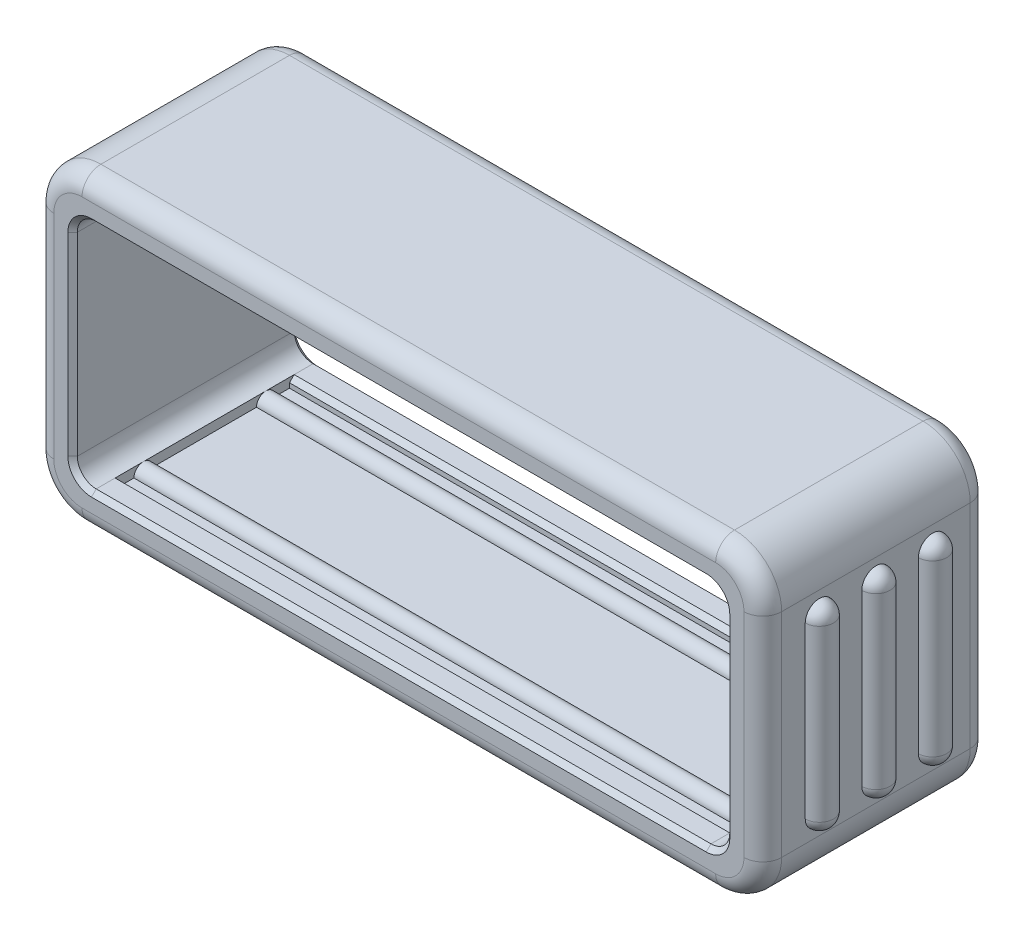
ISO-10303-21;
HEADER;
FILE_DESCRIPTION(('STEP AP214'),'2;1');
FILE_NAME('part.step','',(''),(''),'','','');
FILE_SCHEMA(('AUTOMOTIVE_DESIGN { 1 0 10303 214 1 1 1 1 }'));
ENDSEC;
DATA;
#1=APPLICATION_CONTEXT('core data for automotive mechanical design processes');
#2=APPLICATION_PROTOCOL_DEFINITION('international standard','automotive_design',2000,#1);
#3=PRODUCT_CONTEXT('',#1,'mechanical');
#4=PRODUCT('Part','Part','',(#3));
#5=PRODUCT_RELATED_PRODUCT_CATEGORY('part','',(#4));
#6=PRODUCT_DEFINITION_FORMATION('','',#4);
#7=PRODUCT_DEFINITION_CONTEXT('part definition',#1,'design');
#8=PRODUCT_DEFINITION('design','',#6,#7);
#9=PRODUCT_DEFINITION_SHAPE('','',#8);
#10=(LENGTH_UNIT() NAMED_UNIT(*) SI_UNIT(.MILLI.,.METRE.));
#11=(NAMED_UNIT(*) PLANE_ANGLE_UNIT() SI_UNIT($,.RADIAN.));
#12=(NAMED_UNIT(*) SI_UNIT($,.STERADIAN.) SOLID_ANGLE_UNIT());
#13=UNCERTAINTY_MEASURE_WITH_UNIT(LENGTH_MEASURE(1.E-05),#10,'distance_accuracy_value','');
#14=(GEOMETRIC_REPRESENTATION_CONTEXT(3) GLOBAL_UNCERTAINTY_ASSIGNED_CONTEXT((#13)) GLOBAL_UNIT_ASSIGNED_CONTEXT((#10,
#11,#12)) REPRESENTATION_CONTEXT('',''));
#15=CARTESIAN_POINT('',(0.,0.,0.));
#16=DIRECTION('',(0.,0.,1.));
#17=DIRECTION('',(1.,0.,0.));
#18=AXIS2_PLACEMENT_3D('',#15,#16,#17);
#19=CARTESIAN_POINT('',(8.280499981,-3.374900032,5.334));
#20=DIRECTION('',(1.,0.,0.));
#21=DIRECTION('',(0.,0.,-1.));
#22=AXIS2_PLACEMENT_3D('',#19,#20,#21);
#23=PLANE('',#22);
#24=CARTESIAN_POINT('',(8.280499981,-3.374900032,4.699));
#25=DIRECTION('',(-1.,0.,0.));
#26=DIRECTION('',(0.,0.,1.));
#27=AXIS2_PLACEMENT_3D('',#24,#25,#26);
#28=CIRCLE('',#27,0.254);
#29=CARTESIAN_POINT('',(8.280499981,-3.374900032,4.953));
#30=VERTEX_POINT('',#29);
#31=CARTESIAN_POINT('',(8.280499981,-3.120900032,4.699));
#32=VERTEX_POINT('',#31);
#33=EDGE_CURVE('E503',#30,#32,#28,.T.);
#34=ORIENTED_EDGE('',*,*,#33,.F.);
#35=DIRECTION('',(0.,0.,-1.));
#36=VECTOR('',#35,1.);
#37=CARTESIAN_POINT('',(8.280499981,-3.374900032,5.334));
#38=LINE('',#37,#36);
#39=CARTESIAN_POINT('',(8.280499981,-3.374900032,5.334));
#40=VERTEX_POINT('',#39);
#41=EDGE_CURVE('E487',#40,#30,#38,.T.);
#42=ORIENTED_EDGE('',*,*,#41,.F.);
#43=DIRECTION('',(0.,-1.,0.));
#44=VECTOR('',#43,1.);
#45=CARTESIAN_POINT('',(8.280499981,-3.374900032,5.334));
#46=LINE('',#45,#44);
#47=CARTESIAN_POINT('',(8.280499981,-3.247900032,5.334));
#48=VERTEX_POINT('',#47);
#49=EDGE_CURVE('E571',#48,#40,#46,.T.);
#50=ORIENTED_EDGE('',*,*,#49,.F.);
#51=DIRECTION('',(0.,0.707106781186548,0.707106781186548));
#52=VECTOR('',#51,1.);
#53=CARTESIAN_POINT('',(8.280499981,-3.311400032,5.2705));
#54=LINE('',#53,#52);
#55=CARTESIAN_POINT('',(8.280499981,-3.120900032,5.461));
#56=VERTEX_POINT('',#55);
#57=EDGE_CURVE('E1084',#48,#56,#54,.T.);
#58=ORIENTED_EDGE('',*,*,#57,.T.);
#59=DIRECTION('',(0.,0.,-1.));
#60=VECTOR('',#59,1.);
#61=CARTESIAN_POINT('',(8.280499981,-3.120900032,0.));
#62=LINE('',#61,#60);
#63=EDGE_CURVE('E505',#56,#32,#62,.T.);
#64=ORIENTED_EDGE('',*,*,#63,.T.);
#65=EDGE_LOOP('',(#34,#42,#50,#58,#64));
#66=FACE_BOUND('',#65,.T.);
#67=ADVANCED_FACE('F41',(#66),#23,.F.);
#68=CARTESIAN_POINT('',(8.280499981,-3.374900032,4.445));
#69=VERTEX_POINT('',#68);
#70=EDGE_CURVE('E509',#32,#69,#28,.T.);
#71=ORIENTED_EDGE('',*,*,#70,.F.);
#72=CARTESIAN_POINT('',(8.28049998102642,-3.120900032,1.397));
#73=VERTEX_POINT('',#72);
#74=EDGE_CURVE('E1187',#32,#73,#62,.T.);
#75=ORIENTED_EDGE('',*,*,#74,.T.);
#76=CARTESIAN_POINT('',(8.280499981,-3.374900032,1.397));
#77=DIRECTION('',(-1.,0.,0.));
#78=DIRECTION('',(0.,0.,1.));
#79=AXIS2_PLACEMENT_3D('',#76,#77,#78);
#80=CIRCLE('',#79,0.254);
#81=CARTESIAN_POINT('',(8.280499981,-3.374900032,1.651));
#82=VERTEX_POINT('',#81);
#83=EDGE_CURVE('E520',#82,#73,#80,.T.);
#84=ORIENTED_EDGE('',*,*,#83,.F.);
#85=EDGE_CURVE('E498',#69,#82,#38,.T.);
#86=ORIENTED_EDGE('',*,*,#85,.F.);
#87=EDGE_LOOP('',(#71,#75,#84,#86));
#88=FACE_BOUND('',#87,.T.);
#89=ADVANCED_FACE('F1191',(#88),#23,.F.);
#90=CARTESIAN_POINT('',(-8.280499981,-3.374900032,5.334));
#91=DIRECTION('',(-1.,0.,0.));
#92=DIRECTION('',(0.,0.,1.));
#93=AXIS2_PLACEMENT_3D('',#90,#91,#92);
#94=PLANE('',#93);
#95=CARTESIAN_POINT('',(-8.28049998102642,-3.374900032,4.699));
#96=DIRECTION('',(-1.,0.,0.));
#97=DIRECTION('',(0.,0.,1.));
#98=AXIS2_PLACEMENT_3D('',#95,#96,#97);
#99=CIRCLE('',#98,0.254);
#100=CARTESIAN_POINT('',(-8.280499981,-3.120900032,4.699));
#101=VERTEX_POINT('',#100);
#102=CARTESIAN_POINT('',(-8.280499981,-3.374900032,4.445));
#103=VERTEX_POINT('',#102);
#104=EDGE_CURVE('E522',#101,#103,#99,.T.);
#105=ORIENTED_EDGE('',*,*,#104,.T.);
#106=DIRECTION('',(0.,0.,-1.));
#107=VECTOR('',#106,1.);
#108=CARTESIAN_POINT('',(-8.280499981,-3.374900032,5.334));
#109=LINE('',#108,#107);
#110=CARTESIAN_POINT('',(-8.280499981,-3.374900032,1.651));
#111=VERTEX_POINT('',#110);
#112=EDGE_CURVE('E606',#103,#111,#109,.T.);
#113=ORIENTED_EDGE('',*,*,#112,.T.);
#114=CARTESIAN_POINT('',(-8.28049998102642,-3.374900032,1.397));
#115=DIRECTION('',(-1.,0.,0.));
#116=DIRECTION('',(0.,0.,1.));
#117=AXIS2_PLACEMENT_3D('',#114,#115,#116);
#118=CIRCLE('',#117,0.254);
#119=CARTESIAN_POINT('',(-8.28049998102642,-3.120900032,1.397));
#120=VERTEX_POINT('',#119);
#121=EDGE_CURVE('E528',#111,#120,#118,.T.);
#122=ORIENTED_EDGE('',*,*,#121,.T.);
#123=DIRECTION('',(0.,0.,1.));
#124=VECTOR('',#123,1.);
#125=CARTESIAN_POINT('',(-8.280499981,-3.120900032,6.096));
#126=LINE('',#125,#124);
#127=EDGE_CURVE('E608',#101,#120,#126,.F.);
#128=ORIENTED_EDGE('',*,*,#127,.F.);
#129=EDGE_LOOP('',(#105,#113,#122,#128));
#130=FACE_BOUND('',#129,.T.);
#131=ADVANCED_FACE('F1231',(#130),#94,.F.);
#132=CARTESIAN_POINT('',(-8.280499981,-3.374900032,4.953));
#133=VERTEX_POINT('',#132);
#134=EDGE_CURVE('E516',#133,#101,#99,.T.);
#135=ORIENTED_EDGE('',*,*,#134,.T.);
#136=DIRECTION('',(0.,0.,-1.));
#137=VECTOR('',#136,1.);
#138=CARTESIAN_POINT('',(-8.280499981,-3.120900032,6.096));
#139=LINE('',#138,#137);
#140=CARTESIAN_POINT('',(-8.280499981,-3.120900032,5.461));
#141=VERTEX_POINT('',#140);
#142=EDGE_CURVE('E712',#101,#141,#139,.F.);
#143=ORIENTED_EDGE('',*,*,#142,.T.);
#144=DIRECTION('',(0.,-0.707106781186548,-0.707106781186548));
#145=VECTOR('',#144,1.);
#146=CARTESIAN_POINT('',(-8.280499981,-3.311400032,5.2705));
#147=LINE('',#146,#145);
#148=CARTESIAN_POINT('',(-8.280499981,-3.247900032,5.334));
#149=VERTEX_POINT('',#148);
#150=EDGE_CURVE('E1086',#141,#149,#147,.T.);
#151=ORIENTED_EDGE('',*,*,#150,.T.);
#152=DIRECTION('',(0.,1.,0.));
#153=VECTOR('',#152,1.);
#154=CARTESIAN_POINT('',(-8.280499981,-3.374900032,5.334));
#155=LINE('',#154,#153);
#156=CARTESIAN_POINT('',(-8.280499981,-3.374900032,5.334));
#157=VERTEX_POINT('',#156);
#158=EDGE_CURVE('E574',#157,#149,#155,.T.);
#159=ORIENTED_EDGE('',*,*,#158,.F.);
#160=EDGE_CURVE('E605',#157,#133,#109,.T.);
#161=ORIENTED_EDGE('',*,*,#160,.T.);
#162=EDGE_LOOP('',(#135,#143,#151,#159,#161));
#163=FACE_BOUND('',#162,.T.);
#164=ADVANCED_FACE('F1090',(#163),#94,.F.);
#165=CARTESIAN_POINT('',(8.280499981,-3.374900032,5.334));
#166=DIRECTION('',(0.,-1.,0.));
#167=DIRECTION('',(0.,0.,-1.));
#168=AXIS2_PLACEMENT_3D('',#165,#166,#167);
#169=PLANE('',#168);
#170=DIRECTION('',(1.,0.,0.));
#171=VECTOR('',#170,1.);
#172=CARTESIAN_POINT('',(-500000.,-3.374900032,4.445));
#173=LINE('',#172,#171);
#174=EDGE_CURVE('E508',#103,#69,#173,.T.);
#175=ORIENTED_EDGE('',*,*,#174,.T.);
#176=ORIENTED_EDGE('',*,*,#85,.T.);
#177=DIRECTION('',(1.,0.,0.));
#178=VECTOR('',#177,1.);
#179=CARTESIAN_POINT('',(-500000.,-3.374900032,1.651));
#180=LINE('',#179,#178);
#181=EDGE_CURVE('E531',#82,#111,#180,.F.);
#182=ORIENTED_EDGE('',*,*,#181,.T.);
#183=ORIENTED_EDGE('',*,*,#112,.F.);
#184=EDGE_LOOP('',(#175,#176,#182,#183));
#185=FACE_BOUND('',#184,.T.);
#186=ADVANCED_FACE('F1203',(#185),#169,.F.);
#187=DIRECTION('',(1.,0.,0.));
#188=VECTOR('',#187,1.);
#189=CARTESIAN_POINT('',(-500000.,-3.374900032,4.953));
#190=LINE('',#189,#188);
#191=EDGE_CURVE('E491',#30,#133,#190,.F.);
#192=ORIENTED_EDGE('',*,*,#191,.T.);
#193=ORIENTED_EDGE('',*,*,#160,.F.);
#194=DIRECTION('',(-1.,0.,0.));
#195=VECTOR('',#194,1.);
#196=CARTESIAN_POINT('',(8.280499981,-3.374900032,5.334));
#197=LINE('',#196,#195);
#198=EDGE_CURVE('E494',#40,#157,#197,.T.);
#199=ORIENTED_EDGE('',*,*,#198,.F.);
#200=ORIENTED_EDGE('',*,*,#41,.T.);
#201=EDGE_LOOP('',(#192,#193,#199,#200));
#202=FACE_BOUND('',#201,.T.);
#203=ADVANCED_FACE('F489',(#202),#169,.F.);
#204=CARTESIAN_POINT('',(8.280499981,-3.374900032,1.143));
#205=VERTEX_POINT('',#204);
#206=EDGE_CURVE('E517',#73,#205,#80,.T.);
#207=ORIENTED_EDGE('',*,*,#206,.F.);
#208=CARTESIAN_POINT('',(8.280499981,-3.120900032,0.634999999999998));
#209=VERTEX_POINT('',#208);
#210=EDGE_CURVE('E1185',#73,#209,#62,.T.);
#211=ORIENTED_EDGE('',*,*,#210,.T.);
#212=DIRECTION('',(0.,0.707106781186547,-0.707106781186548));
#213=VECTOR('',#212,1.);
#214=CARTESIAN_POINT('',(8.280499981,-5.597400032,3.1115));
#215=LINE('',#214,#213);
#216=CARTESIAN_POINT('',(8.280499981,-3.247900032,0.762));
#217=VERTEX_POINT('',#216);
#218=EDGE_CURVE('E49',#209,#217,#215,.F.);
#219=ORIENTED_EDGE('',*,*,#218,.T.);
#220=DIRECTION('',(0.,-1.,0.));
#221=VECTOR('',#220,1.);
#222=CARTESIAN_POINT('',(8.280499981,-3.374900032,0.762));
#223=LINE('',#222,#221);
#224=CARTESIAN_POINT('',(8.280499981,-3.374900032,0.762));
#225=VERTEX_POINT('',#224);
#226=EDGE_CURVE('E564',#217,#225,#223,.T.);
#227=ORIENTED_EDGE('',*,*,#226,.T.);
#228=EDGE_CURVE('E500',#205,#225,#38,.T.);
#229=ORIENTED_EDGE('',*,*,#228,.F.);
#230=EDGE_LOOP('',(#207,#211,#219,#227,#229));
#231=FACE_BOUND('',#230,.T.);
#232=ADVANCED_FACE('F1195',(#231),#23,.F.);
#233=CARTESIAN_POINT('',(-8.280499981,-3.374900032,1.143));
#234=VERTEX_POINT('',#233);
#235=EDGE_CURVE('E532',#120,#234,#118,.T.);
#236=ORIENTED_EDGE('',*,*,#235,.T.);
#237=CARTESIAN_POINT('',(-8.280499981,-3.374900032,0.762));
#238=VERTEX_POINT('',#237);
#239=EDGE_CURVE('E497',#234,#238,#109,.T.);
#240=ORIENTED_EDGE('',*,*,#239,.T.);
#241=DIRECTION('',(0.,1.,0.));
#242=VECTOR('',#241,1.);
#243=CARTESIAN_POINT('',(-8.280499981,-3.374900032,0.762));
#244=LINE('',#243,#242);
#245=CARTESIAN_POINT('',(-8.280499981,-3.247900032,0.762));
#246=VERTEX_POINT('',#245);
#247=EDGE_CURVE('E589',#238,#246,#244,.T.);
#248=ORIENTED_EDGE('',*,*,#247,.T.);
#249=DIRECTION('',(0.,-0.707106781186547,0.707106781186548));
#250=VECTOR('',#249,1.);
#251=CARTESIAN_POINT('',(-8.280499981,-5.597400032,3.1115));
#252=LINE('',#251,#250);
#253=CARTESIAN_POINT('',(-8.280499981,-3.120900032,0.634999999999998));
#254=VERTEX_POINT('',#253);
#255=EDGE_CURVE('E11',#246,#254,#252,.F.);
#256=ORIENTED_EDGE('',*,*,#255,.T.);
#257=EDGE_CURVE('E597',#120,#254,#126,.F.);
#258=ORIENTED_EDGE('',*,*,#257,.F.);
#259=EDGE_LOOP('',(#236,#240,#248,#256,#258));
#260=FACE_BOUND('',#259,.T.);
#261=ADVANCED_FACE('F1183',(#260),#94,.F.);
#262=DIRECTION('',(1.,0.,0.));
#263=VECTOR('',#262,1.);
#264=CARTESIAN_POINT('',(-500000.,-3.374900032,1.143));
#265=LINE('',#264,#263);
#266=EDGE_CURVE('E527',#234,#205,#265,.T.);
#267=ORIENTED_EDGE('',*,*,#266,.T.);
#268=ORIENTED_EDGE('',*,*,#228,.T.);
#269=DIRECTION('',(-1.,0.,0.));
#270=VECTOR('',#269,1.);
#271=CARTESIAN_POINT('',(8.280499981,-3.374900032,0.762));
#272=LINE('',#271,#270);
#273=EDGE_CURVE('E585',#225,#238,#272,.T.);
#274=ORIENTED_EDGE('',*,*,#273,.T.);
#275=ORIENTED_EDGE('',*,*,#239,.F.);
#276=EDGE_LOOP('',(#267,#268,#274,#275));
#277=FACE_BOUND('',#276,.T.);
#278=ADVANCED_FACE('F1206',(#277),#169,.F.);
#279=CARTESIAN_POINT('',(8.280499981,3.374900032,5.334));
#280=DIRECTION('',(0.,1.,0.));
#281=DIRECTION('',(0.,0.,1.));
#282=AXIS2_PLACEMENT_3D('',#279,#280,#281);
#283=PLANE('',#282);
#284=DIRECTION('',(1.,0.,0.));
#285=VECTOR('',#284,1.);
#286=CARTESIAN_POINT('',(-500000.,3.374900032,4.953));
#287=LINE('',#286,#285);
#288=CARTESIAN_POINT('',(-8.28049998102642,3.374900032,4.953));
#289=VERTEX_POINT('',#288);
#290=CARTESIAN_POINT('',(8.280499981,3.374900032,4.953));
#291=VERTEX_POINT('',#290);
#292=EDGE_CURVE('E540',#289,#291,#287,.T.);
#293=ORIENTED_EDGE('',*,*,#292,.T.);
#294=DIRECTION('',(0.,0.,-1.));
#295=VECTOR('',#294,1.);
#296=CARTESIAN_POINT('',(8.280499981,3.374900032,5.334));
#297=LINE('',#296,#295);
#298=CARTESIAN_POINT('',(8.280499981,3.374900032,5.334));
#299=VERTEX_POINT('',#298);
#300=EDGE_CURVE('E595',#299,#291,#297,.T.);
#301=ORIENTED_EDGE('',*,*,#300,.F.);
#302=DIRECTION('',(1.,0.,0.));
#303=VECTOR('',#302,1.);
#304=CARTESIAN_POINT('',(8.280499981,3.374900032,5.334));
#305=LINE('',#304,#303);
#306=CARTESIAN_POINT('',(-8.280499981,3.374900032,5.334));
#307=VERTEX_POINT('',#306);
#308=EDGE_CURVE('E577',#307,#299,#305,.T.);
#309=ORIENTED_EDGE('',*,*,#308,.F.);
#310=DIRECTION('',(0.,0.,-1.));
#311=VECTOR('',#310,1.);
#312=CARTESIAN_POINT('',(-8.280499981,3.374900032,5.334));
#313=LINE('',#312,#311);
#314=EDGE_CURVE('E600',#307,#289,#313,.T.);
#315=ORIENTED_EDGE('',*,*,#314,.T.);
#316=EDGE_LOOP('',(#293,#301,#309,#315));
#317=FACE_BOUND('',#316,.T.);
#318=ADVANCED_FACE('F1255',(#317),#283,.F.);
#319=DIRECTION('',(1.,0.,0.));
#320=VECTOR('',#319,1.);
#321=CARTESIAN_POINT('',(-500000.,3.374900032,4.445));
#322=LINE('',#321,#320);
#323=CARTESIAN_POINT('',(8.28049998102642,3.374900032,4.445));
#324=VERTEX_POINT('',#323);
#325=CARTESIAN_POINT('',(-8.28049998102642,3.374900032,4.445));
#326=VERTEX_POINT('',#325);
#327=EDGE_CURVE('E544',#324,#326,#322,.F.);
#328=ORIENTED_EDGE('',*,*,#327,.T.);
#329=CARTESIAN_POINT('',(-8.28049998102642,3.374900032,1.651));
#330=VERTEX_POINT('',#329);
#331=EDGE_CURVE('E603',#326,#330,#313,.T.);
#332=ORIENTED_EDGE('',*,*,#331,.T.);
#333=DIRECTION('',(1.,0.,0.));
#334=VECTOR('',#333,1.);
#335=CARTESIAN_POINT('',(-500000.,3.374900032,1.651));
#336=LINE('',#335,#334);
#337=CARTESIAN_POINT('',(8.280499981,3.374900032,1.651));
#338=VERTEX_POINT('',#337);
#339=EDGE_CURVE('E555',#330,#338,#336,.T.);
#340=ORIENTED_EDGE('',*,*,#339,.T.);
#341=EDGE_CURVE('E598',#324,#338,#297,.T.);
#342=ORIENTED_EDGE('',*,*,#341,.F.);
#343=EDGE_LOOP('',(#328,#332,#340,#342));
#344=FACE_BOUND('',#343,.T.);
#345=ADVANCED_FACE('F1256',(#344),#283,.F.);
#346=CARTESIAN_POINT('',(-8.28049998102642,3.374900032,4.699));
#347=DIRECTION('',(-1.,0.,0.));
#348=DIRECTION('',(0.,0.,1.));
#349=AXIS2_PLACEMENT_3D('',#346,#347,#348);
#350=CIRCLE('',#349,0.254);
#351=CARTESIAN_POINT('',(-8.280499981,3.120900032,4.699));
#352=VERTEX_POINT('',#351);
#353=EDGE_CURVE('E545',#352,#289,#350,.T.);
#354=ORIENTED_EDGE('',*,*,#353,.T.);
#355=ORIENTED_EDGE('',*,*,#314,.F.);
#356=CARTESIAN_POINT('',(-8.280499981,3.24790003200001,5.334));
#357=VERTEX_POINT('',#356);
#358=EDGE_CURVE('E573',#357,#307,#155,.T.);
#359=ORIENTED_EDGE('',*,*,#358,.F.);
#360=DIRECTION('',(0.,-0.707106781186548,0.707106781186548));
#361=VECTOR('',#360,1.);
#362=CARTESIAN_POINT('',(-8.280499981,-0.063499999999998,8.645400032));
#363=LINE('',#362,#361);
#364=CARTESIAN_POINT('',(-8.280499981,3.120900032,5.461));
#365=VERTEX_POINT('',#364);
#366=EDGE_CURVE('E1073',#357,#365,#363,.T.);
#367=ORIENTED_EDGE('',*,*,#366,.T.);
#368=DIRECTION('',(0.,0.,-1.));
#369=VECTOR('',#368,1.);
#370=CARTESIAN_POINT('',(-8.280499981,3.120900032,0.));
#371=LINE('',#370,#369);
#372=EDGE_CURVE('E701',#365,#352,#371,.T.);
#373=ORIENTED_EDGE('',*,*,#372,.T.);
#374=EDGE_LOOP('',(#354,#355,#359,#367,#373));
#375=FACE_BOUND('',#374,.T.);
#376=ADVANCED_FACE('F1304',(#375),#94,.F.);
#377=EDGE_CURVE('E541',#326,#352,#350,.T.);
#378=ORIENTED_EDGE('',*,*,#377,.T.);
#379=CARTESIAN_POINT('',(-8.28049998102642,3.120900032,1.397));
#380=VERTEX_POINT('',#379);
#381=EDGE_CURVE('E1298',#352,#380,#371,.T.);
#382=ORIENTED_EDGE('',*,*,#381,.T.);
#383=CARTESIAN_POINT('',(-8.28049998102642,3.374900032,1.397));
#384=DIRECTION('',(-1.,0.,0.));
#385=DIRECTION('',(0.,0.,1.));
#386=AXIS2_PLACEMENT_3D('',#383,#384,#385);
#387=CIRCLE('',#386,0.254);
#388=EDGE_CURVE('E561',#380,#330,#387,.T.);
#389=ORIENTED_EDGE('',*,*,#388,.T.);
#390=ORIENTED_EDGE('',*,*,#331,.F.);
#391=EDGE_LOOP('',(#378,#382,#389,#390));
#392=FACE_BOUND('',#391,.T.);
#393=ADVANCED_FACE('F1246',(#392),#94,.F.);
#394=CARTESIAN_POINT('',(8.280499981,3.374900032,4.699));
#395=DIRECTION('',(-1.,0.,0.));
#396=DIRECTION('',(0.,0.,1.));
#397=AXIS2_PLACEMENT_3D('',#394,#395,#396);
#398=CIRCLE('',#397,0.254);
#399=CARTESIAN_POINT('',(8.280499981,3.120900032,4.699));
#400=VERTEX_POINT('',#399);
#401=EDGE_CURVE('E537',#324,#400,#398,.T.);
#402=ORIENTED_EDGE('',*,*,#401,.F.);
#403=ORIENTED_EDGE('',*,*,#341,.T.);
#404=CARTESIAN_POINT('',(8.28049998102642,3.374900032,1.397));
#405=DIRECTION('',(1.,0.,0.));
#406=DIRECTION('',(0.,0.,-1.));
#407=AXIS2_PLACEMENT_3D('',#404,#405,#406);
#408=CIRCLE('',#407,0.254);
#409=CARTESIAN_POINT('',(8.28049998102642,3.120900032,1.397));
#410=VERTEX_POINT('',#409);
#411=EDGE_CURVE('E1000',#410,#338,#408,.F.);
#412=ORIENTED_EDGE('',*,*,#411,.F.);
#413=DIRECTION('',(0.,0.,1.));
#414=VECTOR('',#413,1.);
#415=CARTESIAN_POINT('',(8.280499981,3.120900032,6.096));
#416=LINE('',#415,#414);
#417=EDGE_CURVE('E611',#400,#410,#416,.F.);
#418=ORIENTED_EDGE('',*,*,#417,.F.);
#419=EDGE_LOOP('',(#402,#403,#412,#418));
#420=FACE_BOUND('',#419,.T.);
#421=ADVANCED_FACE('F1248',(#420),#23,.F.);
#422=EDGE_CURVE('E535',#400,#291,#398,.T.);
#423=ORIENTED_EDGE('',*,*,#422,.F.);
#424=DIRECTION('',(0.,0.,-1.));
#425=VECTOR('',#424,1.);
#426=CARTESIAN_POINT('',(8.280499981,3.120900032,6.096));
#427=LINE('',#426,#425);
#428=CARTESIAN_POINT('',(8.280499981,3.120900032,5.461));
#429=VERTEX_POINT('',#428);
#430=EDGE_CURVE('E707',#400,#429,#427,.F.);
#431=ORIENTED_EDGE('',*,*,#430,.T.);
#432=DIRECTION('',(0.,0.707106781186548,-0.707106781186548));
#433=VECTOR('',#432,1.);
#434=CARTESIAN_POINT('',(8.280499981,-0.063499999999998,8.645400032));
#435=LINE('',#434,#433);
#436=CARTESIAN_POINT('',(8.280499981,3.24790003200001,5.334));
#437=VERTEX_POINT('',#436);
#438=EDGE_CURVE('E1076',#429,#437,#435,.T.);
#439=ORIENTED_EDGE('',*,*,#438,.T.);
#440=EDGE_CURVE('E568',#299,#437,#46,.T.);
#441=ORIENTED_EDGE('',*,*,#440,.F.);
#442=ORIENTED_EDGE('',*,*,#300,.T.);
#443=EDGE_LOOP('',(#423,#431,#439,#441,#442));
#444=FACE_BOUND('',#443,.T.);
#445=ADVANCED_FACE('F1237',(#444),#23,.F.);
#446=DIRECTION('',(1.,0.,0.));
#447=VECTOR('',#446,1.);
#448=CARTESIAN_POINT('',(-500000.,3.374900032,1.143));
#449=LINE('',#448,#447);
#450=CARTESIAN_POINT('',(8.28049998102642,3.374900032,1.143));
#451=VERTEX_POINT('',#450);
#452=CARTESIAN_POINT('',(-8.28049998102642,3.374900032,1.143));
#453=VERTEX_POINT('',#452);
#454=EDGE_CURVE('E560',#451,#453,#449,.F.);
#455=ORIENTED_EDGE('',*,*,#454,.T.);
#456=CARTESIAN_POINT('',(-8.280499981,3.374900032,0.762));
#457=VERTEX_POINT('',#456);
#458=EDGE_CURVE('E604',#453,#457,#313,.T.);
#459=ORIENTED_EDGE('',*,*,#458,.T.);
#460=DIRECTION('',(1.,0.,0.));
#461=VECTOR('',#460,1.);
#462=CARTESIAN_POINT('',(8.280499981,3.374900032,0.762));
#463=LINE('',#462,#461);
#464=CARTESIAN_POINT('',(8.280499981,3.374900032,0.762));
#465=VERTEX_POINT('',#464);
#466=EDGE_CURVE('E591',#457,#465,#463,.T.);
#467=ORIENTED_EDGE('',*,*,#466,.T.);
#468=EDGE_CURVE('E599',#451,#465,#297,.T.);
#469=ORIENTED_EDGE('',*,*,#468,.F.);
#470=EDGE_LOOP('',(#455,#459,#467,#469));
#471=FACE_BOUND('',#470,.T.);
#472=ADVANCED_FACE('F1243',(#471),#283,.F.);
#473=EDGE_CURVE('E556',#453,#380,#387,.T.);
#474=ORIENTED_EDGE('',*,*,#473,.T.);
#475=CARTESIAN_POINT('',(-8.280499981,3.120900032,0.635000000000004));
#476=VERTEX_POINT('',#475);
#477=EDGE_CURVE('E1296',#380,#476,#371,.T.);
#478=ORIENTED_EDGE('',*,*,#477,.T.);
#479=DIRECTION('',(0.,-0.707106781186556,-0.707106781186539));
#480=VECTOR('',#479,1.);
#481=CARTESIAN_POINT('',(-8.280499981,2.22249999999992,-0.263400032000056));
#482=LINE('',#481,#480);
#483=CARTESIAN_POINT('',(-8.280499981,3.247900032,0.762));
#484=VERTEX_POINT('',#483);
#485=EDGE_CURVE('E1078',#476,#484,#482,.F.);
#486=ORIENTED_EDGE('',*,*,#485,.T.);
#487=EDGE_CURVE('E588',#484,#457,#244,.T.);
#488=ORIENTED_EDGE('',*,*,#487,.T.);
#489=ORIENTED_EDGE('',*,*,#458,.F.);
#490=EDGE_LOOP('',(#474,#478,#486,#488,#489));
#491=FACE_BOUND('',#490,.T.);
#492=ADVANCED_FACE('F1235',(#491),#94,.F.);
#493=CARTESIAN_POINT('',(8.280499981,3.374900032,1.397));
#494=DIRECTION('',(-1.,0.,0.));
#495=DIRECTION('',(0.,0.,1.));
#496=AXIS2_PLACEMENT_3D('',#493,#494,#495);
#497=CIRCLE('',#496,0.254);
#498=EDGE_CURVE('E548',#451,#410,#497,.T.);
#499=ORIENTED_EDGE('',*,*,#498,.F.);
#500=ORIENTED_EDGE('',*,*,#468,.T.);
#501=CARTESIAN_POINT('',(8.280499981,3.247900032,0.762));
#502=VERTEX_POINT('',#501);
#503=EDGE_CURVE('E581',#465,#502,#223,.T.);
#504=ORIENTED_EDGE('',*,*,#503,.T.);
#505=DIRECTION('',(0.,0.707106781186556,0.707106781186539));
#506=VECTOR('',#505,1.);
#507=CARTESIAN_POINT('',(8.280499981,2.22249999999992,-0.263400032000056));
#508=LINE('',#507,#506);
#509=CARTESIAN_POINT('',(8.280499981,3.120900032,0.635000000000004));
#510=VERTEX_POINT('',#509);
#511=EDGE_CURVE('E1080',#502,#510,#508,.F.);
#512=ORIENTED_EDGE('',*,*,#511,.T.);
#513=EDGE_CURVE('E610',#410,#510,#416,.F.);
#514=ORIENTED_EDGE('',*,*,#513,.F.);
#515=EDGE_LOOP('',(#499,#500,#504,#512,#514));
#516=FACE_BOUND('',#515,.T.);
#517=ADVANCED_FACE('F1227',(#516),#23,.F.);
#518=CARTESIAN_POINT('',(-8.788499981,-3.120900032,6.096));
#519=DIRECTION('',(0.,1.,0.));
#520=DIRECTION('',(0.,0.,1.));
#521=AXIS2_PLACEMENT_3D('',#518,#519,#520);
#522=PLANE('',#521);
#523=CARTESIAN_POINT('',(-8.280499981,-3.120900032,0.126999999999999));
#524=VERTEX_POINT('',#523);
#525=EDGE_CURVE('E708',#524,#254,#139,.F.);
#526=ORIENTED_EDGE('',*,*,#525,.T.);
#527=DIRECTION('',(1.,0.,0.));
#528=VECTOR('',#527,1.);
#529=CARTESIAN_POINT('',(-8.788499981,-3.120900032,0.634999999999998));
#530=LINE('',#529,#528);
#531=EDGE_CURVE('E1069',#254,#209,#530,.T.);
#532=ORIENTED_EDGE('',*,*,#531,.T.);
#533=CARTESIAN_POINT('',(8.280499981,-3.120900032,0.126999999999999));
#534=VERTEX_POINT('',#533);
#535=EDGE_CURVE('E711',#209,#534,#62,.T.);
#536=ORIENTED_EDGE('',*,*,#535,.T.);
#537=DIRECTION('',(-1.,0.,0.));
#538=VECTOR('',#537,1.);
#539=CARTESIAN_POINT('',(-8.280499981,-3.120900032,0.126999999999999));
#540=LINE('',#539,#538);
#541=EDGE_CURVE('E975',#534,#524,#540,.T.);
#542=ORIENTED_EDGE('',*,*,#541,.T.);
#543=EDGE_LOOP('',(#526,#532,#536,#542));
#544=FACE_BOUND('',#543,.T.);
#545=ADVANCED_FACE('F1173',(#544),#522,.T.);
#546=CARTESIAN_POINT('',(-8.788499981,3.120900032,6.096));
#547=DIRECTION('',(0.,-1.,0.));
#548=DIRECTION('',(0.,0.,-1.));
#549=AXIS2_PLACEMENT_3D('',#546,#547,#548);
#550=PLANE('',#549);
#551=CARTESIAN_POINT('',(8.280499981,3.120900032,0.126999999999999));
#552=VERTEX_POINT('',#551);
#553=EDGE_CURVE('E702',#552,#510,#427,.F.);
#554=ORIENTED_EDGE('',*,*,#553,.T.);
#555=DIRECTION('',(-1.,0.,0.));
#556=VECTOR('',#555,1.);
#557=CARTESIAN_POINT('',(-8.788499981,3.120900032,0.635000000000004));
#558=LINE('',#557,#556);
#559=EDGE_CURVE('E1055',#510,#476,#558,.T.);
#560=ORIENTED_EDGE('',*,*,#559,.T.);
#561=CARTESIAN_POINT('',(-8.280499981,3.120900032,0.126999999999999));
#562=VERTEX_POINT('',#561);
#563=EDGE_CURVE('E696',#476,#562,#371,.T.);
#564=ORIENTED_EDGE('',*,*,#563,.T.);
#565=DIRECTION('',(1.,0.,0.));
#566=VECTOR('',#565,1.);
#567=CARTESIAN_POINT('',(8.280499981,3.120900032,0.126999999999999));
#568=LINE('',#567,#566);
#569=EDGE_CURVE('E915',#562,#552,#568,.T.);
#570=ORIENTED_EDGE('',*,*,#569,.T.);
#571=EDGE_LOOP('',(#554,#560,#564,#570));
#572=FACE_BOUND('',#571,.T.);
#573=ADVANCED_FACE('F1140',(#572),#550,.T.);
#574=CARTESIAN_POINT('',(9.804499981,4.136900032,6.096));
#575=DIRECTION('',(-1.,0.,0.));
#576=DIRECTION('',(0.,-1.,0.));
#577=AXIS2_PLACEMENT_3D('',#574,#575,#576);
#578=PLANE('',#577);
#579=CARTESIAN_POINT('',(9.80449998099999,-2.286,3.048));
#580=DIRECTION('',(-1.,0.,0.));
#581=DIRECTION('',(0.,-1.,0.));
#582=AXIS2_PLACEMENT_3D('',#579,#580,#581);
#583=CIRCLE('',#582,0.381);
#584=CARTESIAN_POINT('',(9.804499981,-2.286,3.429));
#585=VERTEX_POINT('',#584);
#586=CARTESIAN_POINT('',(9.80449998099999,-2.286,2.667));
#587=VERTEX_POINT('',#586);
#588=EDGE_CURVE('E618',#585,#587,#583,.F.);
#589=ORIENTED_EDGE('',*,*,#588,.F.);
#590=DIRECTION('',(0.,-1.,0.));
#591=VECTOR('',#590,1.);
#592=CARTESIAN_POINT('',(9.804499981,2.286,3.429));
#593=LINE('',#592,#591);
#594=CARTESIAN_POINT('',(9.804499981,2.286,3.429));
#595=VERTEX_POINT('',#594);
#596=EDGE_CURVE('E905',#585,#595,#593,.F.);
#597=ORIENTED_EDGE('',*,*,#596,.T.);
#598=CARTESIAN_POINT('',(9.804499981,2.286,3.048));
#599=DIRECTION('',(-1.,0.,0.));
#600=DIRECTION('',(0.,-1.,0.));
#601=AXIS2_PLACEMENT_3D('',#598,#599,#600);
#602=CIRCLE('',#601,0.381);
#603=CARTESIAN_POINT('',(9.804499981,2.286,2.667));
#604=VERTEX_POINT('',#603);
#605=EDGE_CURVE('E624',#604,#595,#602,.F.);
#606=ORIENTED_EDGE('',*,*,#605,.F.);
#607=DIRECTION('',(0.,-1.,0.));
#608=VECTOR('',#607,1.);
#609=CARTESIAN_POINT('',(9.804499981,2.286,2.667));
#610=LINE('',#609,#608);
#611=EDGE_CURVE('E908',#604,#587,#610,.T.);
#612=ORIENTED_EDGE('',*,*,#611,.T.);
#613=EDGE_LOOP('',(#589,#597,#606,#612));
#614=FACE_BOUND('',#613,.T.);
#615=DIRECTION('',(0.,0.,-1.));
#616=VECTOR('',#615,1.);
#617=CARTESIAN_POINT('',(9.80449998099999,-2.866900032,6.096));
#618=LINE('',#617,#616);
#619=CARTESIAN_POINT('',(9.80449998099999,-2.866900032,5.588));
#620=VERTEX_POINT('',#619);
#621=CARTESIAN_POINT('',(9.80449998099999,-2.866900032,0.508));
#622=VERTEX_POINT('',#621);
#623=EDGE_CURVE('E744',#620,#622,#618,.T.);
#624=ORIENTED_EDGE('',*,*,#623,.T.);
#625=DIRECTION('',(0.,1.,0.));
#626=VECTOR('',#625,1.);
#627=CARTESIAN_POINT('',(9.804499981,4.136900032,0.508));
#628=LINE('',#627,#626);
#629=CARTESIAN_POINT('',(9.804499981,2.866900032,0.508));
#630=VERTEX_POINT('',#629);
#631=EDGE_CURVE('E781',#622,#630,#628,.T.);
#632=ORIENTED_EDGE('',*,*,#631,.T.);
#633=DIRECTION('',(0.,0.,-1.));
#634=VECTOR('',#633,1.);
#635=CARTESIAN_POINT('',(9.804499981,2.866900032,6.096));
#636=LINE('',#635,#634);
#637=CARTESIAN_POINT('',(9.804499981,2.866900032,5.588));
#638=VERTEX_POINT('',#637);
#639=EDGE_CURVE('E747',#630,#638,#636,.F.);
#640=ORIENTED_EDGE('',*,*,#639,.T.);
#641=DIRECTION('',(0.,1.,0.));
#642=VECTOR('',#641,1.);
#643=CARTESIAN_POINT('',(9.80449998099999,-2.866900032,5.588));
#644=LINE('',#643,#642);
#645=EDGE_CURVE('E778',#638,#620,#644,.F.);
#646=ORIENTED_EDGE('',*,*,#645,.T.);
#647=EDGE_LOOP('',(#624,#632,#640,#646));
#648=FACE_BOUND('',#647,.T.);
#649=CARTESIAN_POINT('',(9.80449998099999,-2.286,1.524));
#650=DIRECTION('',(-1.,0.,0.));
#651=DIRECTION('',(0.,-1.,0.));
#652=AXIS2_PLACEMENT_3D('',#649,#650,#651);
#653=CIRCLE('',#652,0.381);
#654=CARTESIAN_POINT('',(9.804499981,-2.286,1.905));
#655=VERTEX_POINT('',#654);
#656=CARTESIAN_POINT('',(9.80449998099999,-2.286,1.143));
#657=VERTEX_POINT('',#656);
#658=EDGE_CURVE('E636',#655,#657,#653,.F.);
#659=ORIENTED_EDGE('',*,*,#658,.F.);
#660=DIRECTION('',(0.,-1.,0.));
#661=VECTOR('',#660,1.);
#662=CARTESIAN_POINT('',(9.804499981,2.286,1.905));
#663=LINE('',#662,#661);
#664=CARTESIAN_POINT('',(9.804499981,2.286,1.905));
#665=VERTEX_POINT('',#664);
#666=EDGE_CURVE('E898',#655,#665,#663,.F.);
#667=ORIENTED_EDGE('',*,*,#666,.T.);
#668=CARTESIAN_POINT('',(9.804499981,2.286,1.524));
#669=DIRECTION('',(-1.,0.,0.));
#670=DIRECTION('',(0.,-1.,0.));
#671=AXIS2_PLACEMENT_3D('',#668,#669,#670);
#672=CIRCLE('',#671,0.381);
#673=CARTESIAN_POINT('',(9.804499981,2.286,1.143));
#674=VERTEX_POINT('',#673);
#675=EDGE_CURVE('E641',#674,#665,#672,.F.);
#676=ORIENTED_EDGE('',*,*,#675,.F.);
#677=DIRECTION('',(0.,-1.,0.));
#678=VECTOR('',#677,1.);
#679=CARTESIAN_POINT('',(9.804499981,2.286,1.143));
#680=LINE('',#679,#678);
#681=EDGE_CURVE('E902',#674,#657,#680,.T.);
#682=ORIENTED_EDGE('',*,*,#681,.T.);
#683=EDGE_LOOP('',(#659,#667,#676,#682));
#684=FACE_BOUND('',#683,.T.);
#685=CARTESIAN_POINT('',(9.80449998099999,-2.286,4.572));
#686=DIRECTION('',(-1.,0.,0.));
#687=DIRECTION('',(0.,-1.,0.));
#688=AXIS2_PLACEMENT_3D('',#685,#686,#687);
#689=CIRCLE('',#688,0.381);
#690=CARTESIAN_POINT('',(9.804499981,-2.286,4.953));
#691=VERTEX_POINT('',#690);
#692=CARTESIAN_POINT('',(9.80449998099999,-2.286,4.191));
#693=VERTEX_POINT('',#692);
#694=EDGE_CURVE('E615',#691,#693,#689,.F.);
#695=ORIENTED_EDGE('',*,*,#694,.F.);
#696=DIRECTION('',(0.,-1.,0.));
#697=VECTOR('',#696,1.);
#698=CARTESIAN_POINT('',(9.804499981,2.286,4.953));
#699=LINE('',#698,#697);
#700=CARTESIAN_POINT('',(9.804499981,2.286,4.953));
#701=VERTEX_POINT('',#700);
#702=EDGE_CURVE('E910',#691,#701,#699,.F.);
#703=ORIENTED_EDGE('',*,*,#702,.T.);
#704=CARTESIAN_POINT('',(9.804499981,2.286,4.572));
#705=DIRECTION('',(-1.,0.,0.));
#706=DIRECTION('',(0.,-1.,0.));
#707=AXIS2_PLACEMENT_3D('',#704,#705,#706);
#708=CIRCLE('',#707,0.381);
#709=CARTESIAN_POINT('',(9.804499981,2.286,4.191));
#710=VERTEX_POINT('',#709);
#711=EDGE_CURVE('E622',#710,#701,#708,.F.);
#712=ORIENTED_EDGE('',*,*,#711,.F.);
#713=DIRECTION('',(0.,-1.,0.));
#714=VECTOR('',#713,1.);
#715=CARTESIAN_POINT('',(9.804499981,2.286,4.191));
#716=LINE('',#715,#714);
#717=EDGE_CURVE('E913',#710,#693,#716,.T.);
#718=ORIENTED_EDGE('',*,*,#717,.T.);
#719=EDGE_LOOP('',(#695,#703,#712,#718));
#720=FACE_BOUND('',#719,.T.);
#721=ADVANCED_FACE('F1487',(#614,#648,#684,#720),#578,.F.);
#722=CARTESIAN_POINT('',(-9.804499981,4.136900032,6.096));
#723=DIRECTION('',(1.,0.,0.));
#724=DIRECTION('',(0.,1.,0.));
#725=AXIS2_PLACEMENT_3D('',#722,#723,#724);
#726=PLANE('',#725);
#727=CARTESIAN_POINT('',(-9.804499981,-2.286,3.048));
#728=DIRECTION('',(1.,0.,0.));
#729=DIRECTION('',(0.,1.,0.));
#730=AXIS2_PLACEMENT_3D('',#727,#728,#729);
#731=CIRCLE('',#730,0.381);
#732=CARTESIAN_POINT('',(-9.804499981,-2.286,2.667));
#733=VERTEX_POINT('',#732);
#734=CARTESIAN_POINT('',(-9.804499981,-2.286,3.429));
#735=VERTEX_POINT('',#734);
#736=EDGE_CURVE('E651',#733,#735,#731,.F.);
#737=ORIENTED_EDGE('',*,*,#736,.F.);
#738=DIRECTION('',(0.,-1.,0.));
#739=VECTOR('',#738,1.);
#740=CARTESIAN_POINT('',(-9.804499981,2.286,2.667));
#741=LINE('',#740,#739);
#742=CARTESIAN_POINT('',(-9.804499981,2.286,2.667));
#743=VERTEX_POINT('',#742);
#744=EDGE_CURVE('E884',#743,#733,#741,.T.);
#745=ORIENTED_EDGE('',*,*,#744,.F.);
#746=CARTESIAN_POINT('',(-9.804499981,2.286,3.048));
#747=DIRECTION('',(1.,0.,0.));
#748=DIRECTION('',(0.,1.,0.));
#749=AXIS2_PLACEMENT_3D('',#746,#747,#748);
#750=CIRCLE('',#749,0.381);
#751=CARTESIAN_POINT('',(-9.804499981,2.286,3.429));
#752=VERTEX_POINT('',#751);
#753=EDGE_CURVE('E657',#752,#743,#750,.F.);
#754=ORIENTED_EDGE('',*,*,#753,.F.);
#755=DIRECTION('',(0.,-1.,0.));
#756=VECTOR('',#755,1.);
#757=CARTESIAN_POINT('',(-9.804499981,2.286,3.429));
#758=LINE('',#757,#756);
#759=EDGE_CURVE('E888',#735,#752,#758,.F.);
#760=ORIENTED_EDGE('',*,*,#759,.F.);
#761=EDGE_LOOP('',(#737,#745,#754,#760));
#762=FACE_BOUND('',#761,.T.);
#763=DIRECTION('',(0.,0.,-1.));
#764=VECTOR('',#763,1.);
#765=CARTESIAN_POINT('',(-9.804499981,2.866900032,6.096));
#766=LINE('',#765,#764);
#767=CARTESIAN_POINT('',(-9.804499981,2.866900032,5.588));
#768=VERTEX_POINT('',#767);
#769=CARTESIAN_POINT('',(-9.804499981,2.866900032,0.508));
#770=VERTEX_POINT('',#769);
#771=EDGE_CURVE('E729',#768,#770,#766,.T.);
#772=ORIENTED_EDGE('',*,*,#771,.T.);
#773=DIRECTION('',(0.,-1.,0.));
#774=VECTOR('',#773,1.);
#775=CARTESIAN_POINT('',(-9.804499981,4.136900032,0.508));
#776=LINE('',#775,#774);
#777=CARTESIAN_POINT('',(-9.804499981,-2.866900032,0.508));
#778=VERTEX_POINT('',#777);
#779=EDGE_CURVE('E798',#770,#778,#776,.T.);
#780=ORIENTED_EDGE('',*,*,#779,.T.);
#781=DIRECTION('',(0.,0.,-1.));
#782=VECTOR('',#781,1.);
#783=CARTESIAN_POINT('',(-9.804499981,-2.866900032,6.096));
#784=LINE('',#783,#782);
#785=CARTESIAN_POINT('',(-9.804499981,-2.866900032,5.588));
#786=VERTEX_POINT('',#785);
#787=EDGE_CURVE('E733',#778,#786,#784,.F.);
#788=ORIENTED_EDGE('',*,*,#787,.T.);
#789=DIRECTION('',(0.,-1.,0.));
#790=VECTOR('',#789,1.);
#791=CARTESIAN_POINT('',(-9.804499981,2.866900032,5.588));
#792=LINE('',#791,#790);
#793=EDGE_CURVE('E796',#786,#768,#792,.F.);
#794=ORIENTED_EDGE('',*,*,#793,.T.);
#795=EDGE_LOOP('',(#772,#780,#788,#794));
#796=FACE_BOUND('',#795,.T.);
#797=CARTESIAN_POINT('',(-9.804499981,-2.286,1.524));
#798=DIRECTION('',(1.,0.,0.));
#799=DIRECTION('',(0.,1.,0.));
#800=AXIS2_PLACEMENT_3D('',#797,#798,#799);
#801=CIRCLE('',#800,0.381);
#802=CARTESIAN_POINT('',(-9.804499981,-2.286,1.143));
#803=VERTEX_POINT('',#802);
#804=CARTESIAN_POINT('',(-9.804499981,-2.286,1.905));
#805=VERTEX_POINT('',#804);
#806=EDGE_CURVE('E673',#803,#805,#801,.F.);
#807=ORIENTED_EDGE('',*,*,#806,.F.);
#808=DIRECTION('',(0.,-1.,0.));
#809=VECTOR('',#808,1.);
#810=CARTESIAN_POINT('',(-9.804499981,2.286,1.143));
#811=LINE('',#810,#809);
#812=CARTESIAN_POINT('',(-9.804499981,2.286,1.143));
#813=VERTEX_POINT('',#812);
#814=EDGE_CURVE('E832',#813,#803,#811,.T.);
#815=ORIENTED_EDGE('',*,*,#814,.F.);
#816=CARTESIAN_POINT('',(-9.804499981,2.286,1.524));
#817=DIRECTION('',(1.,0.,0.));
#818=DIRECTION('',(0.,1.,0.));
#819=AXIS2_PLACEMENT_3D('',#816,#817,#818);
#820=CIRCLE('',#819,0.381);
#821=CARTESIAN_POINT('',(-9.804499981,2.286,1.905));
#822=VERTEX_POINT('',#821);
#823=EDGE_CURVE('E677',#822,#813,#820,.F.);
#824=ORIENTED_EDGE('',*,*,#823,.F.);
#825=DIRECTION('',(0.,-1.,0.));
#826=VECTOR('',#825,1.);
#827=CARTESIAN_POINT('',(-9.804499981,2.286,1.905));
#828=LINE('',#827,#826);
#829=EDGE_CURVE('E881',#805,#822,#828,.F.);
#830=ORIENTED_EDGE('',*,*,#829,.F.);
#831=EDGE_LOOP('',(#807,#815,#824,#830));
#832=FACE_BOUND('',#831,.T.);
#833=CARTESIAN_POINT('',(-9.804499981,-2.286,4.572));
#834=DIRECTION('',(1.,0.,0.));
#835=DIRECTION('',(0.,1.,0.));
#836=AXIS2_PLACEMENT_3D('',#833,#834,#835);
#837=CIRCLE('',#836,0.381);
#838=CARTESIAN_POINT('',(-9.804499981,-2.286,4.191));
#839=VERTEX_POINT('',#838);
#840=CARTESIAN_POINT('',(-9.804499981,-2.286,4.953));
#841=VERTEX_POINT('',#840);
#842=EDGE_CURVE('E647',#839,#841,#837,.F.);
#843=ORIENTED_EDGE('',*,*,#842,.F.);
#844=DIRECTION('',(0.,-1.,0.));
#845=VECTOR('',#844,1.);
#846=CARTESIAN_POINT('',(-9.804499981,2.286,4.191));
#847=LINE('',#846,#845);
#848=CARTESIAN_POINT('',(-9.804499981,2.286,4.191));
#849=VERTEX_POINT('',#848);
#850=EDGE_CURVE('E891',#849,#839,#847,.T.);
#851=ORIENTED_EDGE('',*,*,#850,.F.);
#852=CARTESIAN_POINT('',(-9.804499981,2.286,4.572));
#853=DIRECTION('',(1.,0.,0.));
#854=DIRECTION('',(0.,1.,0.));
#855=AXIS2_PLACEMENT_3D('',#852,#853,#854);
#856=CIRCLE('',#855,0.381);
#857=CARTESIAN_POINT('',(-9.804499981,2.286,4.953));
#858=VERTEX_POINT('',#857);
#859=EDGE_CURVE('E653',#858,#849,#856,.F.);
#860=ORIENTED_EDGE('',*,*,#859,.F.);
#861=DIRECTION('',(0.,-1.,0.));
#862=VECTOR('',#861,1.);
#863=CARTESIAN_POINT('',(-9.804499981,2.286,4.953));
#864=LINE('',#863,#862);
#865=EDGE_CURVE('E895',#841,#858,#864,.F.);
#866=ORIENTED_EDGE('',*,*,#865,.F.);
#867=EDGE_LOOP('',(#843,#851,#860,#866));
#868=FACE_BOUND('',#867,.T.);
#869=ADVANCED_FACE('F1787',(#762,#796,#832,#868),#726,.F.);
#870=CARTESIAN_POINT('',(-9.804499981,-4.136900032,6.096));
#871=DIRECTION('',(0.,0.,1.));
#872=DIRECTION('',(1.,0.,0.));
#873=AXIS2_PLACEMENT_3D('',#870,#871,#872);
#874=PLANE('',#873);
#875=CARTESIAN_POINT('',(-8.280499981,2.612900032,6.096));
#876=DIRECTION('',(0.,0.,1.));
#877=DIRECTION('',(1.,0.,0.));
#878=AXIS2_PLACEMENT_3D('',#875,#876,#877);
#879=CIRCLE('',#878,0.635000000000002);
#880=CARTESIAN_POINT('',(-8.91549998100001,2.612900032,6.096));
#881=VERTEX_POINT('',#880);
#882=CARTESIAN_POINT('',(-8.280499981,3.247900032,6.096));
#883=VERTEX_POINT('',#882);
#884=EDGE_CURVE('E937',#881,#883,#879,.F.);
#885=ORIENTED_EDGE('',*,*,#884,.T.);
#886=DIRECTION('',(1.,0.,0.));
#887=VECTOR('',#886,1.);
#888=CARTESIAN_POINT('',(-9.804499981,3.247900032,6.096));
#889=LINE('',#888,#887);
#890=CARTESIAN_POINT('',(8.280499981,3.247900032,6.096));
#891=VERTEX_POINT('',#890);
#892=EDGE_CURVE('E939',#883,#891,#889,.T.);
#893=ORIENTED_EDGE('',*,*,#892,.T.);
#894=CARTESIAN_POINT('',(8.280499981,2.612900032,6.096));
#895=DIRECTION('',(0.,0.,1.));
#896=DIRECTION('',(1.,0.,0.));
#897=AXIS2_PLACEMENT_3D('',#894,#895,#896);
#898=CIRCLE('',#897,0.635000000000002);
#899=CARTESIAN_POINT('',(8.915499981,2.612900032,6.096));
#900=VERTEX_POINT('',#899);
#901=EDGE_CURVE('E935',#891,#900,#898,.F.);
#902=ORIENTED_EDGE('',*,*,#901,.T.);
#903=DIRECTION('',(0.,-1.,0.));
#904=VECTOR('',#903,1.);
#905=CARTESIAN_POINT('',(8.915499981,-4.136900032,6.096));
#906=LINE('',#905,#904);
#907=CARTESIAN_POINT('',(8.915499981,-2.612900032,6.096));
#908=VERTEX_POINT('',#907);
#909=EDGE_CURVE('E929',#900,#908,#906,.T.);
#910=ORIENTED_EDGE('',*,*,#909,.T.);
#911=CARTESIAN_POINT('',(8.280499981,-2.612900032,6.096));
#912=DIRECTION('',(0.,0.,1.));
#913=DIRECTION('',(1.,0.,0.));
#914=AXIS2_PLACEMENT_3D('',#911,#912,#913);
#915=CIRCLE('',#914,0.635000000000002);
#916=CARTESIAN_POINT('',(8.280499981,-3.247900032,6.096));
#917=VERTEX_POINT('',#916);
#918=EDGE_CURVE('E925',#908,#917,#915,.F.);
#919=ORIENTED_EDGE('',*,*,#918,.T.);
#920=DIRECTION('',(-1.,0.,0.));
#921=VECTOR('',#920,1.);
#922=CARTESIAN_POINT('',(-9.804499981,-3.247900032,6.096));
#923=LINE('',#922,#921);
#924=CARTESIAN_POINT('',(-8.280499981,-3.247900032,6.096));
#925=VERTEX_POINT('',#924);
#926=EDGE_CURVE('E923',#917,#925,#923,.T.);
#927=ORIENTED_EDGE('',*,*,#926,.T.);
#928=CARTESIAN_POINT('',(-8.280499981,-2.612900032,6.096));
#929=DIRECTION('',(0.,0.,1.));
#930=DIRECTION('',(1.,0.,0.));
#931=AXIS2_PLACEMENT_3D('',#928,#929,#930);
#932=CIRCLE('',#931,0.635000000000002);
#933=CARTESIAN_POINT('',(-8.91549998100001,-2.612900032,6.096));
#934=VERTEX_POINT('',#933);
#935=EDGE_CURVE('E927',#925,#934,#932,.F.);
#936=ORIENTED_EDGE('',*,*,#935,.T.);
#937=DIRECTION('',(0.,1.,0.));
#938=VECTOR('',#937,1.);
#939=CARTESIAN_POINT('',(-8.91549998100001,-4.136900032,6.096));
#940=LINE('',#939,#938);
#941=EDGE_CURVE('E932',#934,#881,#940,.T.);
#942=ORIENTED_EDGE('',*,*,#941,.T.);
#943=EDGE_LOOP('',(#885,#893,#902,#910,#919,#927,#936,#942));
#944=FACE_BOUND('',#943,.T.);
#945=DIRECTION('',(0.,1.,0.));
#946=VECTOR('',#945,1.);
#947=CARTESIAN_POINT('',(9.296499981,2.866900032,6.096));
#948=LINE('',#947,#946);
#949=CARTESIAN_POINT('',(9.29649998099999,-2.866900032,6.096));
#950=VERTEX_POINT('',#949);
#951=CARTESIAN_POINT('',(9.296499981,2.866900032,6.096));
#952=VERTEX_POINT('',#951);
#953=EDGE_CURVE('E820',#950,#952,#948,.T.);
#954=ORIENTED_EDGE('',*,*,#953,.T.);
#955=CARTESIAN_POINT('',(8.53449998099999,2.866900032,6.096));
#956=DIRECTION('',(0.,0.,1.));
#957=DIRECTION('',(1.,0.,0.));
#958=AXIS2_PLACEMENT_3D('',#955,#956,#957);
#959=CIRCLE('',#958,0.762);
#960=CARTESIAN_POINT('',(8.53449998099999,3.628900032,6.096));
#961=VERTEX_POINT('',#960);
#962=EDGE_CURVE('E823',#952,#961,#959,.T.);
#963=ORIENTED_EDGE('',*,*,#962,.T.);
#964=DIRECTION('',(-1.,0.,0.));
#965=VECTOR('',#964,1.);
#966=CARTESIAN_POINT('',(-8.534499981,3.628900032,6.096));
#967=LINE('',#966,#965);
#968=CARTESIAN_POINT('',(-8.534499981,3.628900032,6.096));
#969=VERTEX_POINT('',#968);
#970=EDGE_CURVE('E806',#961,#969,#967,.T.);
#971=ORIENTED_EDGE('',*,*,#970,.T.);
#972=CARTESIAN_POINT('',(-8.534499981,2.866900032,6.096));
#973=DIRECTION('',(0.,0.,1.));
#974=DIRECTION('',(1.,0.,0.));
#975=AXIS2_PLACEMENT_3D('',#972,#973,#974);
#976=CIRCLE('',#975,0.762);
#977=CARTESIAN_POINT('',(-9.296499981,2.866900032,6.096));
#978=VERTEX_POINT('',#977);
#979=EDGE_CURVE('E809',#969,#978,#976,.T.);
#980=ORIENTED_EDGE('',*,*,#979,.T.);
#981=DIRECTION('',(0.,-1.,0.));
#982=VECTOR('',#981,1.);
#983=CARTESIAN_POINT('',(-9.296499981,-2.866900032,6.096));
#984=LINE('',#983,#982);
#985=CARTESIAN_POINT('',(-9.296499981,-2.866900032,6.096));
#986=VERTEX_POINT('',#985);
#987=EDGE_CURVE('E811',#978,#986,#984,.T.);
#988=ORIENTED_EDGE('',*,*,#987,.T.);
#989=CARTESIAN_POINT('',(-8.534499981,-2.866900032,6.096));
#990=DIRECTION('',(0.,0.,1.));
#991=DIRECTION('',(1.,0.,0.));
#992=AXIS2_PLACEMENT_3D('',#989,#990,#991);
#993=CIRCLE('',#992,0.762);
#994=CARTESIAN_POINT('',(-8.534499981,-3.628900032,6.096));
#995=VERTEX_POINT('',#994);
#996=EDGE_CURVE('E814',#986,#995,#993,.T.);
#997=ORIENTED_EDGE('',*,*,#996,.T.);
#998=DIRECTION('',(1.,0.,0.));
#999=VECTOR('',#998,1.);
#1000=CARTESIAN_POINT('',(8.53449998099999,-3.628900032,6.096));
#1001=LINE('',#1000,#999);
#1002=CARTESIAN_POINT('',(8.53449998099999,-3.628900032,6.096));
#1003=VERTEX_POINT('',#1002);
#1004=EDGE_CURVE('E816',#995,#1003,#1001,.T.);
#1005=ORIENTED_EDGE('',*,*,#1004,.T.);
#1006=CARTESIAN_POINT('',(8.53449998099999,-2.866900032,6.096));
#1007=DIRECTION('',(0.,0.,1.));
#1008=DIRECTION('',(1.,0.,0.));
#1009=AXIS2_PLACEMENT_3D('',#1006,#1007,#1008);
#1010=CIRCLE('',#1009,0.762);
#1011=EDGE_CURVE('E818',#1003,#950,#1010,.T.);
#1012=ORIENTED_EDGE('',*,*,#1011,.T.);
#1013=EDGE_LOOP('',(#954,#963,#971,#980,#988,#997,#1005,#1012));
#1014=FACE_BOUND('',#1013,.T.);
#1015=ADVANCED_FACE('F1334',(#944,#1014),#874,.T.);
#1016=CARTESIAN_POINT('',(-9.804499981,-4.136900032,0.));
#1017=DIRECTION('',(0.,0.,1.));
#1018=DIRECTION('',(1.,0.,0.));
#1019=AXIS2_PLACEMENT_3D('',#1016,#1017,#1018);
#1020=PLANE('',#1019);
#1021=CARTESIAN_POINT('',(8.280499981,2.612900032,0.));
#1022=DIRECTION('',(0.,0.,1.));
#1023=DIRECTION('',(1.,0.,0.));
#1024=AXIS2_PLACEMENT_3D('',#1021,#1022,#1023);
#1025=CIRCLE('',#1024,0.634999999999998);
#1026=CARTESIAN_POINT('',(8.91549998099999,2.612900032,0.));
#1027=VERTEX_POINT('',#1026);
#1028=CARTESIAN_POINT('',(8.280499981,3.247900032,0.));
#1029=VERTEX_POINT('',#1028);
#1030=EDGE_CURVE('E991',#1027,#1029,#1025,.T.);
#1031=ORIENTED_EDGE('',*,*,#1030,.T.);
#1032=DIRECTION('',(-1.,0.,0.));
#1033=VECTOR('',#1032,1.);
#1034=CARTESIAN_POINT('',(-8.280499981,3.247900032,0.));
#1035=LINE('',#1034,#1033);
#1036=CARTESIAN_POINT('',(-8.280499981,3.247900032,0.));
#1037=VERTEX_POINT('',#1036);
#1038=EDGE_CURVE('E996',#1029,#1037,#1035,.T.);
#1039=ORIENTED_EDGE('',*,*,#1038,.T.);
#1040=CARTESIAN_POINT('',(-8.280499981,2.612900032,0.));
#1041=DIRECTION('',(0.,0.,1.));
#1042=DIRECTION('',(1.,0.,0.));
#1043=AXIS2_PLACEMENT_3D('',#1040,#1041,#1042);
#1044=CIRCLE('',#1043,0.634999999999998);
#1045=CARTESIAN_POINT('',(-8.915499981,2.612900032,0.));
#1046=VERTEX_POINT('',#1045);
#1047=EDGE_CURVE('E994',#1037,#1046,#1044,.T.);
#1048=ORIENTED_EDGE('',*,*,#1047,.T.);
#1049=DIRECTION('',(0.,-1.,0.));
#1050=VECTOR('',#1049,1.);
#1051=CARTESIAN_POINT('',(-8.915499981,-2.612900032,0.));
#1052=LINE('',#1051,#1050);
#1053=CARTESIAN_POINT('',(-8.915499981,-2.612900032,0.));
#1054=VERTEX_POINT('',#1053);
#1055=EDGE_CURVE('E988',#1046,#1054,#1052,.T.);
#1056=ORIENTED_EDGE('',*,*,#1055,.T.);
#1057=CARTESIAN_POINT('',(-8.280499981,-2.612900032,0.));
#1058=DIRECTION('',(0.,0.,1.));
#1059=DIRECTION('',(1.,0.,0.));
#1060=AXIS2_PLACEMENT_3D('',#1057,#1058,#1059);
#1061=CIRCLE('',#1060,0.634999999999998);
#1062=CARTESIAN_POINT('',(-8.280499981,-3.247900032,0.));
#1063=VERTEX_POINT('',#1062);
#1064=EDGE_CURVE('E984',#1054,#1063,#1061,.T.);
#1065=ORIENTED_EDGE('',*,*,#1064,.T.);
#1066=DIRECTION('',(1.,0.,0.));
#1067=VECTOR('',#1066,1.);
#1068=CARTESIAN_POINT('',(8.28049998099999,-3.247900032,0.));
#1069=LINE('',#1068,#1067);
#1070=CARTESIAN_POINT('',(8.280499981,-3.247900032,0.));
#1071=VERTEX_POINT('',#1070);
#1072=EDGE_CURVE('E980',#1063,#1071,#1069,.T.);
#1073=ORIENTED_EDGE('',*,*,#1072,.T.);
#1074=CARTESIAN_POINT('',(8.280499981,-2.612900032,0.));
#1075=DIRECTION('',(0.,0.,1.));
#1076=DIRECTION('',(1.,0.,0.));
#1077=AXIS2_PLACEMENT_3D('',#1074,#1075,#1076);
#1078=CIRCLE('',#1077,0.634999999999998);
#1079=CARTESIAN_POINT('',(8.915499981,-2.612900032,0.));
#1080=VERTEX_POINT('',#1079);
#1081=EDGE_CURVE('E982',#1071,#1080,#1078,.T.);
#1082=ORIENTED_EDGE('',*,*,#1081,.T.);
#1083=DIRECTION('',(0.,1.,0.));
#1084=VECTOR('',#1083,1.);
#1085=CARTESIAN_POINT('',(8.91549998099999,2.612900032,0.));
#1086=LINE('',#1085,#1084);
#1087=EDGE_CURVE('E986',#1080,#1027,#1086,.T.);
#1088=ORIENTED_EDGE('',*,*,#1087,.T.);
#1089=EDGE_LOOP('',(#1031,#1039,#1048,#1056,#1065,#1073,#1082,#1088));
#1090=FACE_BOUND('',#1089,.T.);
#1091=DIRECTION('',(-1.,0.,0.));
#1092=VECTOR('',#1091,1.);
#1093=CARTESIAN_POINT('',(-9.804499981,3.628900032,0.));
#1094=LINE('',#1093,#1092);
#1095=CARTESIAN_POINT('',(-8.534499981,3.628900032,0.));
#1096=VERTEX_POINT('',#1095);
#1097=CARTESIAN_POINT('',(8.53449998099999,3.628900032,0.));
#1098=VERTEX_POINT('',#1097);
#1099=EDGE_CURVE('E750',#1096,#1098,#1094,.F.);
#1100=ORIENTED_EDGE('',*,*,#1099,.T.);
#1101=CARTESIAN_POINT('',(8.53449998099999,2.866900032,0.));
#1102=DIRECTION('',(0.,0.,1.));
#1103=DIRECTION('',(1.,0.,0.));
#1104=AXIS2_PLACEMENT_3D('',#1101,#1102,#1103);
#1105=CIRCLE('',#1104,0.762);
#1106=CARTESIAN_POINT('',(9.296499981,2.866900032,0.));
#1107=VERTEX_POINT('',#1106);
#1108=EDGE_CURVE('E766',#1098,#1107,#1105,.F.);
#1109=ORIENTED_EDGE('',*,*,#1108,.T.);
#1110=DIRECTION('',(0.,1.,0.));
#1111=VECTOR('',#1110,1.);
#1112=CARTESIAN_POINT('',(9.29649998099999,-4.13690003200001,0.));
#1113=LINE('',#1112,#1111);
#1114=CARTESIAN_POINT('',(9.29649998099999,-2.866900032,0.));
#1115=VERTEX_POINT('',#1114);
#1116=EDGE_CURVE('E764',#1107,#1115,#1113,.F.);
#1117=ORIENTED_EDGE('',*,*,#1116,.T.);
#1118=CARTESIAN_POINT('',(8.53449998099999,-2.866900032,0.));
#1119=DIRECTION('',(0.,0.,1.));
#1120=DIRECTION('',(1.,0.,0.));
#1121=AXIS2_PLACEMENT_3D('',#1118,#1119,#1120);
#1122=CIRCLE('',#1121,0.762);
#1123=CARTESIAN_POINT('',(8.53449998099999,-3.628900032,0.));
#1124=VERTEX_POINT('',#1123);
#1125=EDGE_CURVE('E762',#1115,#1124,#1122,.F.);
#1126=ORIENTED_EDGE('',*,*,#1125,.T.);
#1127=DIRECTION('',(1.,0.,0.));
#1128=VECTOR('',#1127,1.);
#1129=CARTESIAN_POINT('',(-9.804499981,-3.628900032,0.));
#1130=LINE('',#1129,#1128);
#1131=CARTESIAN_POINT('',(-8.534499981,-3.628900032,0.));
#1132=VERTEX_POINT('',#1131);
#1133=EDGE_CURVE('E760',#1124,#1132,#1130,.F.);
#1134=ORIENTED_EDGE('',*,*,#1133,.T.);
#1135=CARTESIAN_POINT('',(-8.534499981,-2.866900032,0.));
#1136=DIRECTION('',(0.,0.,1.));
#1137=DIRECTION('',(1.,0.,0.));
#1138=AXIS2_PLACEMENT_3D('',#1135,#1136,#1137);
#1139=CIRCLE('',#1138,0.762);
#1140=CARTESIAN_POINT('',(-9.296499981,-2.866900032,0.));
#1141=VERTEX_POINT('',#1140);
#1142=EDGE_CURVE('E758',#1132,#1141,#1139,.F.);
#1143=ORIENTED_EDGE('',*,*,#1142,.T.);
#1144=DIRECTION('',(0.,-1.,0.));
#1145=VECTOR('',#1144,1.);
#1146=CARTESIAN_POINT('',(-9.296499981,-4.136900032,0.));
#1147=LINE('',#1146,#1145);
#1148=CARTESIAN_POINT('',(-9.296499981,2.866900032,0.));
#1149=VERTEX_POINT('',#1148);
#1150=EDGE_CURVE('E755',#1141,#1149,#1147,.F.);
#1151=ORIENTED_EDGE('',*,*,#1150,.T.);
#1152=CARTESIAN_POINT('',(-8.534499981,2.866900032,0.));
#1153=DIRECTION('',(0.,0.,1.));
#1154=DIRECTION('',(1.,0.,0.));
#1155=AXIS2_PLACEMENT_3D('',#1152,#1153,#1154);
#1156=CIRCLE('',#1155,0.762);
#1157=EDGE_CURVE('E753',#1149,#1096,#1156,.F.);
#1158=ORIENTED_EDGE('',*,*,#1157,.T.);
#1159=EDGE_LOOP('',(#1100,#1109,#1117,#1126,#1134,#1143,#1151,#1158));
#1160=FACE_BOUND('',#1159,.T.);
#1161=ADVANCED_FACE('F1153',(#1090,#1160),#1020,.F.);
#1162=CARTESIAN_POINT('',(-9.804499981,-4.136900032,6.096));
#1163=DIRECTION('',(0.,1.,0.));
#1164=DIRECTION('',(-1.,0.,0.));
#1165=AXIS2_PLACEMENT_3D('',#1162,#1163,#1164);
#1166=PLANE('',#1165);
#1167=DIRECTION('',(0.,0.,-1.));
#1168=VECTOR('',#1167,1.);
#1169=CARTESIAN_POINT('',(-8.534499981,-4.136900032,6.096));
#1170=LINE('',#1169,#1168);
#1171=CARTESIAN_POINT('',(-8.534499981,-4.136900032,5.588));
#1172=VERTEX_POINT('',#1171);
#1173=CARTESIAN_POINT('',(-8.534499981,-4.136900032,0.508));
#1174=VERTEX_POINT('',#1173);
#1175=EDGE_CURVE('E726',#1172,#1174,#1170,.T.);
#1176=ORIENTED_EDGE('',*,*,#1175,.T.);
#1177=DIRECTION('',(1.,0.,0.));
#1178=VECTOR('',#1177,1.);
#1179=CARTESIAN_POINT('',(-9.804499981,-4.136900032,0.508));
#1180=LINE('',#1179,#1178);
#1181=CARTESIAN_POINT('',(8.53449998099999,-4.136900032,0.508));
#1182=VERTEX_POINT('',#1181);
#1183=EDGE_CURVE('E790',#1174,#1182,#1180,.T.);
#1184=ORIENTED_EDGE('',*,*,#1183,.T.);
#1185=DIRECTION('',(0.,0.,-1.));
#1186=VECTOR('',#1185,1.);
#1187=CARTESIAN_POINT('',(8.53449998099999,-4.136900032,6.096));
#1188=LINE('',#1187,#1186);
#1189=CARTESIAN_POINT('',(8.53449998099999,-4.136900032,5.588));
#1190=VERTEX_POINT('',#1189);
#1191=EDGE_CURVE('E723',#1182,#1190,#1188,.F.);
#1192=ORIENTED_EDGE('',*,*,#1191,.T.);
#1193=DIRECTION('',(1.,0.,0.));
#1194=VECTOR('',#1193,1.);
#1195=CARTESIAN_POINT('',(-8.534499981,-4.136900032,5.588));
#1196=LINE('',#1195,#1194);
#1197=EDGE_CURVE('E787',#1190,#1172,#1196,.F.);
#1198=ORIENTED_EDGE('',*,*,#1197,.T.);
#1199=EDGE_LOOP('',(#1176,#1184,#1192,#1198));
#1200=FACE_BOUND('',#1199,.T.);
#1201=ADVANCED_FACE('F1776',(#1200),#1166,.F.);
#1202=CARTESIAN_POINT('',(-9.804499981,4.136900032,6.096));
#1203=DIRECTION('',(0.,-1.,0.));
#1204=DIRECTION('',(0.,0.,-1.));
#1205=AXIS2_PLACEMENT_3D('',#1202,#1203,#1204);
#1206=PLANE('',#1205);
#1207=DIRECTION('',(0.,0.,-1.));
#1208=VECTOR('',#1207,1.);
#1209=CARTESIAN_POINT('',(8.53449998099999,4.136900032,6.096));
#1210=LINE('',#1209,#1208);
#1211=CARTESIAN_POINT('',(8.53449998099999,4.136900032,5.588));
#1212=VERTEX_POINT('',#1211);
#1213=CARTESIAN_POINT('',(8.53449998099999,4.136900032,0.508));
#1214=VERTEX_POINT('',#1213);
#1215=EDGE_CURVE('E736',#1212,#1214,#1210,.T.);
#1216=ORIENTED_EDGE('',*,*,#1215,.T.);
#1217=DIRECTION('',(-1.,0.,0.));
#1218=VECTOR('',#1217,1.);
#1219=CARTESIAN_POINT('',(-9.804499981,4.136900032,0.508));
#1220=LINE('',#1219,#1218);
#1221=CARTESIAN_POINT('',(-8.534499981,4.136900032,0.508));
#1222=VERTEX_POINT('',#1221);
#1223=EDGE_CURVE('E829',#1214,#1222,#1220,.T.);
#1224=ORIENTED_EDGE('',*,*,#1223,.T.);
#1225=DIRECTION('',(0.,0.,-1.));
#1226=VECTOR('',#1225,1.);
#1227=CARTESIAN_POINT('',(-8.534499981,4.136900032,6.096));
#1228=LINE('',#1227,#1226);
#1229=CARTESIAN_POINT('',(-8.534499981,4.136900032,5.588));
#1230=VERTEX_POINT('',#1229);
#1231=EDGE_CURVE('E740',#1222,#1230,#1228,.F.);
#1232=ORIENTED_EDGE('',*,*,#1231,.T.);
#1233=DIRECTION('',(-1.,0.,0.));
#1234=VECTOR('',#1233,1.);
#1235=CARTESIAN_POINT('',(8.53449998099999,4.136900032,5.588));
#1236=LINE('',#1235,#1234);
#1237=EDGE_CURVE('E826',#1230,#1212,#1236,.F.);
#1238=ORIENTED_EDGE('',*,*,#1237,.T.);
#1239=EDGE_LOOP('',(#1216,#1224,#1232,#1238));
#1240=FACE_BOUND('',#1239,.T.);
#1241=ADVANCED_FACE('F1766',(#1240),#1206,.F.);
#1242=CARTESIAN_POINT('',(-8.788499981,3.120900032,6.096));
#1243=DIRECTION('',(1.,0.,0.));
#1244=DIRECTION('',(0.,0.,-1.));
#1245=AXIS2_PLACEMENT_3D('',#1242,#1243,#1244);
#1246=PLANE('',#1245);
#1247=DIRECTION('',(0.,0.,-1.));
#1248=VECTOR('',#1247,1.);
#1249=CARTESIAN_POINT('',(-8.788499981,2.612900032,6.096));
#1250=LINE('',#1249,#1248);
#1251=CARTESIAN_POINT('',(-8.788499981,2.612900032,0.126999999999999));
#1252=VERTEX_POINT('',#1251);
#1253=CARTESIAN_POINT('',(-8.788499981,2.612900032,5.969));
#1254=VERTEX_POINT('',#1253);
#1255=EDGE_CURVE('E716',#1252,#1254,#1250,.F.);
#1256=ORIENTED_EDGE('',*,*,#1255,.T.);
#1257=DIRECTION('',(0.,-1.,0.));
#1258=VECTOR('',#1257,1.);
#1259=CARTESIAN_POINT('',(-8.788499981,3.120900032,5.969));
#1260=LINE('',#1259,#1258);
#1261=CARTESIAN_POINT('',(-8.788499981,-2.612900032,5.969));
#1262=VERTEX_POINT('',#1261);
#1263=EDGE_CURVE('E957',#1254,#1262,#1260,.T.);
#1264=ORIENTED_EDGE('',*,*,#1263,.T.);
#1265=DIRECTION('',(0.,0.,-1.));
#1266=VECTOR('',#1265,1.);
#1267=CARTESIAN_POINT('',(-8.788499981,-2.612900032,0.));
#1268=LINE('',#1267,#1266);
#1269=CARTESIAN_POINT('',(-8.788499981,-2.612900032,0.126999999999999));
#1270=VERTEX_POINT('',#1269);
#1271=EDGE_CURVE('E720',#1262,#1270,#1268,.T.);
#1272=ORIENTED_EDGE('',*,*,#1271,.T.);
#1273=DIRECTION('',(0.,1.,0.));
#1274=VECTOR('',#1273,1.);
#1275=CARTESIAN_POINT('',(-8.788499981,2.612900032,0.126999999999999));
#1276=LINE('',#1275,#1274);
#1277=EDGE_CURVE('E954',#1270,#1252,#1276,.T.);
#1278=ORIENTED_EDGE('',*,*,#1277,.T.);
#1279=EDGE_LOOP('',(#1256,#1264,#1272,#1278));
#1280=FACE_BOUND('',#1279,.T.);
#1281=ADVANCED_FACE('F1323',(#1280),#1246,.T.);
#1282=CARTESIAN_POINT('',(8.280499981,-3.120900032,5.969));
#1283=VERTEX_POINT('',#1282);
#1284=EDGE_CURVE('E713',#1283,#56,#62,.T.);
#1285=ORIENTED_EDGE('',*,*,#1284,.T.);
#1286=DIRECTION('',(-1.,0.,0.));
#1287=VECTOR('',#1286,1.);
#1288=CARTESIAN_POINT('',(-8.280499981,-3.120900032,5.461));
#1289=LINE('',#1288,#1287);
#1290=EDGE_CURVE('E1065',#56,#141,#1289,.T.);
#1291=ORIENTED_EDGE('',*,*,#1290,.T.);
#1292=CARTESIAN_POINT('',(-8.280499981,-3.120900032,5.969));
#1293=VERTEX_POINT('',#1292);
#1294=EDGE_CURVE('E706',#141,#1293,#139,.F.);
#1295=ORIENTED_EDGE('',*,*,#1294,.T.);
#1296=DIRECTION('',(1.,0.,0.));
#1297=VECTOR('',#1296,1.);
#1298=CARTESIAN_POINT('',(-8.788499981,-3.120900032,5.969));
#1299=LINE('',#1298,#1297);
#1300=EDGE_CURVE('E977',#1293,#1283,#1299,.T.);
#1301=ORIENTED_EDGE('',*,*,#1300,.T.);
#1302=EDGE_LOOP('',(#1285,#1291,#1295,#1301));
#1303=FACE_BOUND('',#1302,.T.);
#1304=ADVANCED_FACE('F1099',(#1303),#522,.T.);
#1305=CARTESIAN_POINT('',(8.788499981,3.120900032,6.096));
#1306=DIRECTION('',(-1.,0.,0.));
#1307=DIRECTION('',(0.,-1.,0.));
#1308=AXIS2_PLACEMENT_3D('',#1305,#1306,#1307);
#1309=PLANE('',#1308);
#1310=DIRECTION('',(0.,0.,-1.));
#1311=VECTOR('',#1310,1.);
#1312=CARTESIAN_POINT('',(8.788499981,-2.612900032,6.096));
#1313=LINE('',#1312,#1311);
#1314=CARTESIAN_POINT('',(8.788499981,-2.612900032,0.126999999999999));
#1315=VERTEX_POINT('',#1314);
#1316=CARTESIAN_POINT('',(8.788499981,-2.612900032,5.969));
#1317=VERTEX_POINT('',#1316);
#1318=EDGE_CURVE('E689',#1315,#1317,#1313,.F.);
#1319=ORIENTED_EDGE('',*,*,#1318,.T.);
#1320=DIRECTION('',(0.,1.,0.));
#1321=VECTOR('',#1320,1.);
#1322=CARTESIAN_POINT('',(8.788499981,3.120900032,5.969));
#1323=LINE('',#1322,#1321);
#1324=CARTESIAN_POINT('',(8.788499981,2.612900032,5.969));
#1325=VERTEX_POINT('',#1324);
#1326=EDGE_CURVE('E962',#1317,#1325,#1323,.T.);
#1327=ORIENTED_EDGE('',*,*,#1326,.T.);
#1328=DIRECTION('',(0.,0.,-1.));
#1329=VECTOR('',#1328,1.);
#1330=CARTESIAN_POINT('',(8.788499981,2.612900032,0.));
#1331=LINE('',#1330,#1329);
#1332=CARTESIAN_POINT('',(8.788499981,2.612900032,0.126999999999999));
#1333=VERTEX_POINT('',#1332);
#1334=EDGE_CURVE('E692',#1325,#1333,#1331,.T.);
#1335=ORIENTED_EDGE('',*,*,#1334,.T.);
#1336=DIRECTION('',(0.,-1.,0.));
#1337=VECTOR('',#1336,1.);
#1338=CARTESIAN_POINT('',(8.788499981,-2.612900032,0.126999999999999));
#1339=LINE('',#1338,#1337);
#1340=EDGE_CURVE('E960',#1333,#1315,#1339,.T.);
#1341=ORIENTED_EDGE('',*,*,#1340,.T.);
#1342=EDGE_LOOP('',(#1319,#1327,#1335,#1341));
#1343=FACE_BOUND('',#1342,.T.);
#1344=ADVANCED_FACE('F1124',(#1343),#1309,.T.);
#1345=CARTESIAN_POINT('',(-8.280499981,3.120900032,5.969));
#1346=VERTEX_POINT('',#1345);
#1347=EDGE_CURVE('E697',#1346,#365,#371,.T.);
#1348=ORIENTED_EDGE('',*,*,#1347,.T.);
#1349=DIRECTION('',(1.,0.,0.));
#1350=VECTOR('',#1349,1.);
#1351=CARTESIAN_POINT('',(8.280499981,3.120900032,5.461));
#1352=LINE('',#1351,#1350);
#1353=EDGE_CURVE('E1051',#365,#429,#1352,.T.);
#1354=ORIENTED_EDGE('',*,*,#1353,.T.);
#1355=CARTESIAN_POINT('',(8.280499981,3.120900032,5.969));
#1356=VERTEX_POINT('',#1355);
#1357=EDGE_CURVE('E700',#429,#1356,#427,.F.);
#1358=ORIENTED_EDGE('',*,*,#1357,.T.);
#1359=DIRECTION('',(-1.,0.,0.));
#1360=VECTOR('',#1359,1.);
#1361=CARTESIAN_POINT('',(-8.788499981,3.120900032,5.969));
#1362=LINE('',#1361,#1360);
#1363=EDGE_CURVE('E919',#1356,#1346,#1362,.T.);
#1364=ORIENTED_EDGE('',*,*,#1363,.T.);
#1365=EDGE_LOOP('',(#1348,#1354,#1358,#1364));
#1366=FACE_BOUND('',#1365,.T.);
#1367=ADVANCED_FACE('F1316',(#1366),#550,.T.);
#1368=CARTESIAN_POINT('',(8.280499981,2.612900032,6.096));
#1369=DIRECTION('',(0.,0.,1.));
#1370=DIRECTION('',(1.,0.,0.));
#1371=AXIS2_PLACEMENT_3D('',#1368,#1369,#1370);
#1372=CYLINDRICAL_SURFACE('',#1371,0.508);
#1373=ORIENTED_EDGE('',*,*,#1334,.F.);
#1374=CARTESIAN_POINT('',(8.280499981,2.612900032,5.969));
#1375=DIRECTION('',(0.,0.,1.));
#1376=DIRECTION('',(1.,0.,0.));
#1377=AXIS2_PLACEMENT_3D('',#1374,#1375,#1376);
#1378=CIRCLE('',#1377,0.508);
#1379=EDGE_CURVE('E951',#1325,#1356,#1378,.T.);
#1380=ORIENTED_EDGE('',*,*,#1379,.T.);
#1381=ORIENTED_EDGE('',*,*,#1357,.F.);
#1382=ORIENTED_EDGE('',*,*,#430,.F.);
#1383=ORIENTED_EDGE('',*,*,#417,.T.);
#1384=ORIENTED_EDGE('',*,*,#513,.T.);
#1385=ORIENTED_EDGE('',*,*,#553,.F.);
#1386=CARTESIAN_POINT('',(8.280499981,2.612900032,0.126999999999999));
#1387=DIRECTION('',(0.,0.,1.));
#1388=DIRECTION('',(1.,0.,0.));
#1389=AXIS2_PLACEMENT_3D('',#1386,#1387,#1388);
#1390=CIRCLE('',#1389,0.508);
#1391=EDGE_CURVE('E948',#552,#1333,#1390,.F.);
#1392=ORIENTED_EDGE('',*,*,#1391,.T.);
#1393=EDGE_LOOP('',(#1373,#1380,#1381,#1382,#1383,#1384,#1385,#1392));
#1394=FACE_BOUND('',#1393,.T.);
#1395=ADVANCED_FACE('F1127',(#1394),#1372,.F.);
#1396=CARTESIAN_POINT('',(8.280499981,-2.612900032,6.096));
#1397=DIRECTION('',(0.,0.,1.));
#1398=DIRECTION('',(1.,0.,0.));
#1399=AXIS2_PLACEMENT_3D('',#1396,#1397,#1398);
#1400=CYLINDRICAL_SURFACE('',#1399,0.508);
#1401=ORIENTED_EDGE('',*,*,#1284,.F.);
#1402=CARTESIAN_POINT('',(8.280499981,-2.612900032,5.969));
#1403=DIRECTION('',(0.,0.,1.));
#1404=DIRECTION('',(1.,0.,0.));
#1405=AXIS2_PLACEMENT_3D('',#1402,#1403,#1404);
#1406=CIRCLE('',#1405,0.508);
#1407=EDGE_CURVE('E973',#1283,#1317,#1406,.T.);
#1408=ORIENTED_EDGE('',*,*,#1407,.T.);
#1409=ORIENTED_EDGE('',*,*,#1318,.F.);
#1410=CARTESIAN_POINT('',(8.280499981,-2.612900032,0.126999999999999));
#1411=DIRECTION('',(0.,0.,1.));
#1412=DIRECTION('',(1.,0.,0.));
#1413=AXIS2_PLACEMENT_3D('',#1410,#1411,#1412);
#1414=CIRCLE('',#1413,0.508);
#1415=EDGE_CURVE('E970',#1315,#534,#1414,.F.);
#1416=ORIENTED_EDGE('',*,*,#1415,.T.);
#1417=ORIENTED_EDGE('',*,*,#535,.F.);
#1418=ORIENTED_EDGE('',*,*,#210,.F.);
#1419=ORIENTED_EDGE('',*,*,#74,.F.);
#1420=ORIENTED_EDGE('',*,*,#63,.F.);
#1421=EDGE_LOOP('',(#1401,#1408,#1409,#1416,#1417,#1418,#1419,#1420));
#1422=FACE_BOUND('',#1421,.T.);
#1423=ADVANCED_FACE('F1104',(#1422),#1400,.F.);
#1424=CARTESIAN_POINT('',(-8.280499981,-2.612900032,6.096));
#1425=DIRECTION('',(0.,0.,1.));
#1426=DIRECTION('',(1.,0.,0.));
#1427=AXIS2_PLACEMENT_3D('',#1424,#1425,#1426);
#1428=CYLINDRICAL_SURFACE('',#1427,0.508);
#1429=ORIENTED_EDGE('',*,*,#1271,.F.);
#1430=CARTESIAN_POINT('',(-8.280499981,-2.612900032,5.969));
#1431=DIRECTION('',(0.,0.,1.));
#1432=DIRECTION('',(1.,0.,0.));
#1433=AXIS2_PLACEMENT_3D('',#1430,#1431,#1432);
#1434=CIRCLE('',#1433,0.508);
#1435=EDGE_CURVE('E967',#1262,#1293,#1434,.T.);
#1436=ORIENTED_EDGE('',*,*,#1435,.T.);
#1437=ORIENTED_EDGE('',*,*,#1294,.F.);
#1438=ORIENTED_EDGE('',*,*,#142,.F.);
#1439=ORIENTED_EDGE('',*,*,#127,.T.);
#1440=ORIENTED_EDGE('',*,*,#257,.T.);
#1441=ORIENTED_EDGE('',*,*,#525,.F.);
#1442=CARTESIAN_POINT('',(-8.280499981,-2.612900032,0.126999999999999));
#1443=DIRECTION('',(0.,0.,1.));
#1444=DIRECTION('',(1.,0.,0.));
#1445=AXIS2_PLACEMENT_3D('',#1442,#1443,#1444);
#1446=CIRCLE('',#1445,0.508);
#1447=EDGE_CURVE('E965',#524,#1270,#1446,.F.);
#1448=ORIENTED_EDGE('',*,*,#1447,.T.);
#1449=EDGE_LOOP('',(#1429,#1436,#1437,#1438,#1439,#1440,#1441,#1448));
#1450=FACE_BOUND('',#1449,.T.);
#1451=ADVANCED_FACE('F1177',(#1450),#1428,.F.);
#1452=CARTESIAN_POINT('',(-8.280499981,2.612900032,6.096));
#1453=DIRECTION('',(0.,0.,1.));
#1454=DIRECTION('',(1.,0.,0.));
#1455=AXIS2_PLACEMENT_3D('',#1452,#1453,#1454);
#1456=CYLINDRICAL_SURFACE('',#1455,0.508);
#1457=ORIENTED_EDGE('',*,*,#1347,.F.);
#1458=CARTESIAN_POINT('',(-8.280499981,2.612900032,5.969));
#1459=DIRECTION('',(0.,0.,1.));
#1460=DIRECTION('',(1.,0.,0.));
#1461=AXIS2_PLACEMENT_3D('',#1458,#1459,#1460);
#1462=CIRCLE('',#1461,0.508);
#1463=EDGE_CURVE('E946',#1346,#1254,#1462,.T.);
#1464=ORIENTED_EDGE('',*,*,#1463,.T.);
#1465=ORIENTED_EDGE('',*,*,#1255,.F.);
#1466=CARTESIAN_POINT('',(-8.280499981,2.612900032,0.126999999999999));
#1467=DIRECTION('',(0.,0.,1.));
#1468=DIRECTION('',(1.,0.,0.));
#1469=AXIS2_PLACEMENT_3D('',#1466,#1467,#1468);
#1470=CIRCLE('',#1469,0.508);
#1471=EDGE_CURVE('E943',#1252,#562,#1470,.F.);
#1472=ORIENTED_EDGE('',*,*,#1471,.T.);
#1473=ORIENTED_EDGE('',*,*,#563,.F.);
#1474=ORIENTED_EDGE('',*,*,#477,.F.);
#1475=ORIENTED_EDGE('',*,*,#381,.F.);
#1476=ORIENTED_EDGE('',*,*,#372,.F.);
#1477=EDGE_LOOP('',(#1457,#1464,#1465,#1472,#1473,#1474,#1475,#1476));
#1478=FACE_BOUND('',#1477,.T.);
#1479=ADVANCED_FACE('F1295',(#1478),#1456,.F.);
#1480=CARTESIAN_POINT('',(-8.534499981,-2.866900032,6.096));
#1481=DIRECTION('',(0.,0.,-1.));
#1482=DIRECTION('',(-1.,0.,0.));
#1483=AXIS2_PLACEMENT_3D('',#1480,#1481,#1482);
#1484=CYLINDRICAL_SURFACE('',#1483,1.27);
#1485=ORIENTED_EDGE('',*,*,#787,.F.);
#1486=CARTESIAN_POINT('',(-8.534499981,-2.866900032,0.508));
#1487=DIRECTION('',(0.,0.,1.));
#1488=DIRECTION('',(1.,0.,0.));
#1489=AXIS2_PLACEMENT_3D('',#1486,#1487,#1488);
#1490=CIRCLE('',#1489,1.27);
#1491=EDGE_CURVE('E794',#778,#1174,#1490,.T.);
#1492=ORIENTED_EDGE('',*,*,#1491,.T.);
#1493=ORIENTED_EDGE('',*,*,#1175,.F.);
#1494=CARTESIAN_POINT('',(-8.534499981,-2.866900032,5.588));
#1495=DIRECTION('',(0.,0.,1.));
#1496=DIRECTION('',(1.,0.,0.));
#1497=AXIS2_PLACEMENT_3D('',#1494,#1495,#1496);
#1498=CIRCLE('',#1497,1.27);
#1499=EDGE_CURVE('E792',#1172,#786,#1498,.F.);
#1500=ORIENTED_EDGE('',*,*,#1499,.T.);
#1501=EDGE_LOOP('',(#1485,#1492,#1493,#1500));
#1502=FACE_BOUND('',#1501,.T.);
#1503=ADVANCED_FACE('F1430',(#1502),#1484,.T.);
#1504=CARTESIAN_POINT('',(-8.534499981,2.866900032,6.096));
#1505=DIRECTION('',(0.,0.,-1.));
#1506=DIRECTION('',(-1.,0.,0.));
#1507=AXIS2_PLACEMENT_3D('',#1504,#1505,#1506);
#1508=CYLINDRICAL_SURFACE('',#1507,1.27);
#1509=ORIENTED_EDGE('',*,*,#1231,.F.);
#1510=CARTESIAN_POINT('',(-8.534499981,2.866900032,0.508));
#1511=DIRECTION('',(0.,0.,1.));
#1512=DIRECTION('',(1.,0.,0.));
#1513=AXIS2_PLACEMENT_3D('',#1510,#1511,#1512);
#1514=CIRCLE('',#1513,1.27);
#1515=EDGE_CURVE('E804',#1222,#770,#1514,.T.);
#1516=ORIENTED_EDGE('',*,*,#1515,.T.);
#1517=ORIENTED_EDGE('',*,*,#771,.F.);
#1518=CARTESIAN_POINT('',(-8.534499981,2.866900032,5.588));
#1519=DIRECTION('',(0.,0.,1.));
#1520=DIRECTION('',(1.,0.,0.));
#1521=AXIS2_PLACEMENT_3D('',#1518,#1519,#1520);
#1522=CIRCLE('',#1521,1.27);
#1523=EDGE_CURVE('E801',#768,#1230,#1522,.F.);
#1524=ORIENTED_EDGE('',*,*,#1523,.T.);
#1525=EDGE_LOOP('',(#1509,#1516,#1517,#1524));
#1526=FACE_BOUND('',#1525,.T.);
#1527=ADVANCED_FACE('F2161',(#1526),#1508,.T.);
#1528=CARTESIAN_POINT('',(8.53449998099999,2.866900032,6.096));
#1529=DIRECTION('',(0.,0.,-1.));
#1530=DIRECTION('',(-1.,0.,0.));
#1531=AXIS2_PLACEMENT_3D('',#1528,#1529,#1530);
#1532=CYLINDRICAL_SURFACE('',#1531,1.27);
#1533=ORIENTED_EDGE('',*,*,#639,.F.);
#1534=CARTESIAN_POINT('',(8.53449998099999,2.866900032,0.508));
#1535=DIRECTION('',(0.,0.,1.));
#1536=DIRECTION('',(1.,0.,0.));
#1537=AXIS2_PLACEMENT_3D('',#1534,#1535,#1536);
#1538=CIRCLE('',#1537,1.27);
#1539=EDGE_CURVE('E774',#630,#1214,#1538,.T.);
#1540=ORIENTED_EDGE('',*,*,#1539,.T.);
#1541=ORIENTED_EDGE('',*,*,#1215,.F.);
#1542=CARTESIAN_POINT('',(8.53449998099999,2.866900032,5.588));
#1543=DIRECTION('',(0.,0.,1.));
#1544=DIRECTION('',(1.,0.,0.));
#1545=AXIS2_PLACEMENT_3D('',#1542,#1543,#1544);
#1546=CIRCLE('',#1545,1.27);
#1547=EDGE_CURVE('E770',#1212,#638,#1546,.F.);
#1548=ORIENTED_EDGE('',*,*,#1547,.T.);
#1549=EDGE_LOOP('',(#1533,#1540,#1541,#1548));
#1550=FACE_BOUND('',#1549,.T.);
#1551=ADVANCED_FACE('F2151',(#1550),#1532,.T.);
#1552=CARTESIAN_POINT('',(8.53449998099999,-2.866900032,6.096));
#1553=DIRECTION('',(0.,0.,-1.));
#1554=DIRECTION('',(-1.,0.,0.));
#1555=AXIS2_PLACEMENT_3D('',#1552,#1553,#1554);
#1556=CYLINDRICAL_SURFACE('',#1555,1.27);
#1557=ORIENTED_EDGE('',*,*,#1191,.F.);
#1558=CARTESIAN_POINT('',(8.53449998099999,-2.866900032,0.508));
#1559=DIRECTION('',(0.,0.,1.));
#1560=DIRECTION('',(1.,0.,0.));
#1561=AXIS2_PLACEMENT_3D('',#1558,#1559,#1560);
#1562=CIRCLE('',#1561,1.27);
#1563=EDGE_CURVE('E785',#1182,#622,#1562,.T.);
#1564=ORIENTED_EDGE('',*,*,#1563,.T.);
#1565=ORIENTED_EDGE('',*,*,#623,.F.);
#1566=CARTESIAN_POINT('',(8.53449998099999,-2.866900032,5.588));
#1567=DIRECTION('',(0.,0.,1.));
#1568=DIRECTION('',(1.,0.,0.));
#1569=AXIS2_PLACEMENT_3D('',#1566,#1567,#1568);
#1570=CIRCLE('',#1569,1.27);
#1571=EDGE_CURVE('E783',#620,#1190,#1570,.F.);
#1572=ORIENTED_EDGE('',*,*,#1571,.T.);
#1573=EDGE_LOOP('',(#1557,#1564,#1565,#1572));
#1574=FACE_BOUND('',#1573,.T.);
#1575=ADVANCED_FACE('F2140',(#1574),#1556,.T.);
#1576=CARTESIAN_POINT('',(-8.534499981,-2.866900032,0.508));
#1577=DIRECTION('',(0.,0.,1.));
#1578=DIRECTION('',(1.,0.,0.));
#1579=AXIS2_PLACEMENT_3D('',#1576,#1577,#1578);
#1580=TOROIDAL_SURFACE('',#1579,0.762,0.508);
#1581=CARTESIAN_POINT('',(-8.534499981,-3.628900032,0.508));
#1582=DIRECTION('',(1.,0.,0.));
#1583=DIRECTION('',(0.,0.,-1.));
#1584=AXIS2_PLACEMENT_3D('',#1581,#1582,#1583);
#1585=CIRCLE('',#1584,0.508);
#1586=EDGE_CURVE('E851',#1174,#1132,#1585,.T.);
#1587=ORIENTED_EDGE('',*,*,#1586,.F.);
#1588=ORIENTED_EDGE('',*,*,#1491,.F.);
#1589=CARTESIAN_POINT('',(-9.296499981,-2.866900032,0.508));
#1590=DIRECTION('',(0.,1.,0.));
#1591=DIRECTION('',(0.,0.,1.));
#1592=AXIS2_PLACEMENT_3D('',#1589,#1590,#1591);
#1593=CIRCLE('',#1592,0.508);
#1594=EDGE_CURVE('E693',#1141,#778,#1593,.T.);
#1595=ORIENTED_EDGE('',*,*,#1594,.F.);
#1596=ORIENTED_EDGE('',*,*,#1142,.F.);
#1597=EDGE_LOOP('',(#1587,#1588,#1595,#1596));
#1598=FACE_BOUND('',#1597,.T.);
#1599=ADVANCED_FACE('F2131',(#1598),#1580,.T.);
#1600=CARTESIAN_POINT('',(-9.296499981,4.136900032,0.508));
#1601=DIRECTION('',(0.,-1.,0.));
#1602=DIRECTION('',(1.,0.,0.));
#1603=AXIS2_PLACEMENT_3D('',#1600,#1601,#1602);
#1604=CYLINDRICAL_SURFACE('',#1603,0.508);
#1605=ORIENTED_EDGE('',*,*,#1594,.T.);
#1606=ORIENTED_EDGE('',*,*,#779,.F.);
#1607=CARTESIAN_POINT('',(-9.296499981,2.866900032,0.508));
#1608=DIRECTION('',(0.,1.,0.));
#1609=DIRECTION('',(0.,0.,1.));
#1610=AXIS2_PLACEMENT_3D('',#1607,#1608,#1609);
#1611=CIRCLE('',#1610,0.508);
#1612=EDGE_CURVE('E848',#1149,#770,#1611,.T.);
#1613=ORIENTED_EDGE('',*,*,#1612,.F.);
#1614=ORIENTED_EDGE('',*,*,#1150,.F.);
#1615=EDGE_LOOP('',(#1605,#1606,#1613,#1614));
#1616=FACE_BOUND('',#1615,.T.);
#1617=ADVANCED_FACE('F2121',(#1616),#1604,.T.);
#1618=CARTESIAN_POINT('',(-9.804499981,-3.628900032,0.508));
#1619=DIRECTION('',(1.,0.,0.));
#1620=DIRECTION('',(0.,1.,0.));
#1621=AXIS2_PLACEMENT_3D('',#1618,#1619,#1620);
#1622=CYLINDRICAL_SURFACE('',#1621,0.508);
#1623=ORIENTED_EDGE('',*,*,#1586,.T.);
#1624=ORIENTED_EDGE('',*,*,#1133,.F.);
#1625=CARTESIAN_POINT('',(8.53449998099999,-3.628900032,0.508));
#1626=DIRECTION('',(1.,0.,0.));
#1627=DIRECTION('',(0.,0.,-1.));
#1628=AXIS2_PLACEMENT_3D('',#1625,#1626,#1627);
#1629=CIRCLE('',#1628,0.508);
#1630=EDGE_CURVE('E845',#1182,#1124,#1629,.T.);
#1631=ORIENTED_EDGE('',*,*,#1630,.F.);
#1632=ORIENTED_EDGE('',*,*,#1183,.F.);
#1633=EDGE_LOOP('',(#1623,#1624,#1631,#1632));
#1634=FACE_BOUND('',#1633,.T.);
#1635=ADVANCED_FACE('F2110',(#1634),#1622,.T.);
#1636=CARTESIAN_POINT('',(-8.534499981,2.866900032,0.508));
#1637=DIRECTION('',(0.,0.,1.));
#1638=DIRECTION('',(1.,0.,0.));
#1639=AXIS2_PLACEMENT_3D('',#1636,#1637,#1638);
#1640=TOROIDAL_SURFACE('',#1639,0.762,0.508);
#1641=ORIENTED_EDGE('',*,*,#1612,.T.);
#1642=ORIENTED_EDGE('',*,*,#1515,.F.);
#1643=CARTESIAN_POINT('',(-8.534499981,3.628900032,0.508));
#1644=DIRECTION('',(1.,0.,0.));
#1645=DIRECTION('',(0.,0.,-1.));
#1646=AXIS2_PLACEMENT_3D('',#1643,#1644,#1645);
#1647=CIRCLE('',#1646,0.508);
#1648=EDGE_CURVE('E842',#1096,#1222,#1647,.T.);
#1649=ORIENTED_EDGE('',*,*,#1648,.F.);
#1650=ORIENTED_EDGE('',*,*,#1157,.F.);
#1651=EDGE_LOOP('',(#1641,#1642,#1649,#1650));
#1652=FACE_BOUND('',#1651,.T.);
#1653=ADVANCED_FACE('F2099',(#1652),#1640,.T.);
#1654=CARTESIAN_POINT('',(8.53449998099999,-2.866900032,0.508));
#1655=DIRECTION('',(0.,0.,1.));
#1656=DIRECTION('',(1.,0.,0.));
#1657=AXIS2_PLACEMENT_3D('',#1654,#1655,#1656);
#1658=TOROIDAL_SURFACE('',#1657,0.762,0.508);
#1659=ORIENTED_EDGE('',*,*,#1630,.T.);
#1660=ORIENTED_EDGE('',*,*,#1125,.F.);
#1661=CARTESIAN_POINT('',(9.29649998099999,-2.866900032,0.508));
#1662=DIRECTION('',(0.,1.,0.));
#1663=DIRECTION('',(0.,0.,1.));
#1664=AXIS2_PLACEMENT_3D('',#1661,#1662,#1663);
#1665=CIRCLE('',#1664,0.508);
#1666=EDGE_CURVE('E839',#622,#1115,#1665,.T.);
#1667=ORIENTED_EDGE('',*,*,#1666,.F.);
#1668=ORIENTED_EDGE('',*,*,#1563,.F.);
#1669=EDGE_LOOP('',(#1659,#1660,#1667,#1668));
#1670=FACE_BOUND('',#1669,.T.);
#1671=ADVANCED_FACE('F2090',(#1670),#1658,.T.);
#1672=CARTESIAN_POINT('',(-9.804499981,3.628900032,0.508));
#1673=DIRECTION('',(-1.,0.,0.));
#1674=DIRECTION('',(0.,0.,1.));
#1675=AXIS2_PLACEMENT_3D('',#1672,#1673,#1674);
#1676=CYLINDRICAL_SURFACE('',#1675,0.508);
#1677=ORIENTED_EDGE('',*,*,#1648,.T.);
#1678=ORIENTED_EDGE('',*,*,#1223,.F.);
#1679=CARTESIAN_POINT('',(8.53449998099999,3.628900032,0.508));
#1680=DIRECTION('',(1.,0.,0.));
#1681=DIRECTION('',(0.,0.,-1.));
#1682=AXIS2_PLACEMENT_3D('',#1679,#1680,#1681);
#1683=CIRCLE('',#1682,0.508);
#1684=EDGE_CURVE('E835',#1098,#1214,#1683,.T.);
#1685=ORIENTED_EDGE('',*,*,#1684,.F.);
#1686=ORIENTED_EDGE('',*,*,#1099,.F.);
#1687=EDGE_LOOP('',(#1677,#1678,#1685,#1686));
#1688=FACE_BOUND('',#1687,.T.);
#1689=ADVANCED_FACE('F2080',(#1688),#1676,.T.);
#1690=CARTESIAN_POINT('',(9.296499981,4.136900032,0.508));
#1691=DIRECTION('',(0.,1.,0.));
#1692=DIRECTION('',(-1.,0.,0.));
#1693=AXIS2_PLACEMENT_3D('',#1690,#1691,#1692);
#1694=CYLINDRICAL_SURFACE('',#1693,0.508);
#1695=ORIENTED_EDGE('',*,*,#1666,.T.);
#1696=ORIENTED_EDGE('',*,*,#1116,.F.);
#1697=CARTESIAN_POINT('',(9.296499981,2.866900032,0.508));
#1698=DIRECTION('',(0.,1.,0.));
#1699=DIRECTION('',(0.,0.,1.));
#1700=AXIS2_PLACEMENT_3D('',#1697,#1698,#1699);
#1701=CIRCLE('',#1700,0.508);
#1702=EDGE_CURVE('E833',#630,#1107,#1701,.T.);
#1703=ORIENTED_EDGE('',*,*,#1702,.F.);
#1704=ORIENTED_EDGE('',*,*,#631,.F.);
#1705=EDGE_LOOP('',(#1695,#1696,#1703,#1704));
#1706=FACE_BOUND('',#1705,.T.);
#1707=ADVANCED_FACE('F2069',(#1706),#1694,.T.);
#1708=CARTESIAN_POINT('',(8.53449998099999,2.866900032,0.508));
#1709=DIRECTION('',(0.,0.,1.));
#1710=DIRECTION('',(1.,0.,0.));
#1711=AXIS2_PLACEMENT_3D('',#1708,#1709,#1710);
#1712=TOROIDAL_SURFACE('',#1711,0.762,0.508);
#1713=ORIENTED_EDGE('',*,*,#1684,.T.);
#1714=ORIENTED_EDGE('',*,*,#1539,.F.);
#1715=ORIENTED_EDGE('',*,*,#1702,.T.);
#1716=ORIENTED_EDGE('',*,*,#1108,.F.);
#1717=EDGE_LOOP('',(#1713,#1714,#1715,#1716));
#1718=FACE_BOUND('',#1717,.T.);
#1719=ADVANCED_FACE('F2058',(#1718),#1712,.T.);
#1720=CARTESIAN_POINT('',(-8.534499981,-2.866900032,5.588));
#1721=DIRECTION('',(0.,0.,1.));
#1722=DIRECTION('',(1.,0.,0.));
#1723=AXIS2_PLACEMENT_3D('',#1720,#1721,#1722);
#1724=TOROIDAL_SURFACE('',#1723,0.762,0.508);
#1725=CARTESIAN_POINT('',(-9.296499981,-2.866900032,5.588));
#1726=DIRECTION('',(0.,1.,0.));
#1727=DIRECTION('',(0.,0.,1.));
#1728=AXIS2_PLACEMENT_3D('',#1725,#1726,#1727);
#1729=CIRCLE('',#1728,0.508);
#1730=EDGE_CURVE('E873',#786,#986,#1729,.T.);
#1731=ORIENTED_EDGE('',*,*,#1730,.F.);
#1732=ORIENTED_EDGE('',*,*,#1499,.F.);
#1733=CARTESIAN_POINT('',(-8.534499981,-3.628900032,5.588));
#1734=DIRECTION('',(1.,0.,0.));
#1735=DIRECTION('',(0.,0.,-1.));
#1736=AXIS2_PLACEMENT_3D('',#1733,#1734,#1735);
#1737=CIRCLE('',#1736,0.508);
#1738=EDGE_CURVE('E836',#995,#1172,#1737,.T.);
#1739=ORIENTED_EDGE('',*,*,#1738,.F.);
#1740=ORIENTED_EDGE('',*,*,#996,.F.);
#1741=EDGE_LOOP('',(#1731,#1732,#1739,#1740));
#1742=FACE_BOUND('',#1741,.T.);
#1743=ADVANCED_FACE('F2049',(#1742),#1724,.T.);
#1744=CARTESIAN_POINT('',(-9.804499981,-3.628900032,5.588));
#1745=DIRECTION('',(-1.,0.,0.));
#1746=DIRECTION('',(0.,-1.,0.));
#1747=AXIS2_PLACEMENT_3D('',#1744,#1745,#1746);
#1748=CYLINDRICAL_SURFACE('',#1747,0.508);
#1749=ORIENTED_EDGE('',*,*,#1738,.T.);
#1750=ORIENTED_EDGE('',*,*,#1197,.F.);
#1751=CARTESIAN_POINT('',(8.53449998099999,-3.628900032,5.588));
#1752=DIRECTION('',(1.,0.,0.));
#1753=DIRECTION('',(0.,0.,-1.));
#1754=AXIS2_PLACEMENT_3D('',#1751,#1752,#1753);
#1755=CIRCLE('',#1754,0.508);
#1756=EDGE_CURVE('E870',#1003,#1190,#1755,.T.);
#1757=ORIENTED_EDGE('',*,*,#1756,.F.);
#1758=ORIENTED_EDGE('',*,*,#1004,.F.);
#1759=EDGE_LOOP('',(#1749,#1750,#1757,#1758));
#1760=FACE_BOUND('',#1759,.T.);
#1761=ADVANCED_FACE('F2039',(#1760),#1748,.T.);
#1762=CARTESIAN_POINT('',(-9.296499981,-4.136900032,5.588));
#1763=DIRECTION('',(0.,1.,0.));
#1764=DIRECTION('',(-1.,0.,0.));
#1765=AXIS2_PLACEMENT_3D('',#1762,#1763,#1764);
#1766=CYLINDRICAL_SURFACE('',#1765,0.508);
#1767=ORIENTED_EDGE('',*,*,#1730,.T.);
#1768=ORIENTED_EDGE('',*,*,#987,.F.);
#1769=CARTESIAN_POINT('',(-9.296499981,2.866900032,5.588));
#1770=DIRECTION('',(0.,1.,0.));
#1771=DIRECTION('',(0.,0.,1.));
#1772=AXIS2_PLACEMENT_3D('',#1769,#1770,#1771);
#1773=CIRCLE('',#1772,0.508);
#1774=EDGE_CURVE('E867',#768,#978,#1773,.T.);
#1775=ORIENTED_EDGE('',*,*,#1774,.F.);
#1776=ORIENTED_EDGE('',*,*,#793,.F.);
#1777=EDGE_LOOP('',(#1767,#1768,#1775,#1776));
#1778=FACE_BOUND('',#1777,.T.);
#1779=ADVANCED_FACE('F2028',(#1778),#1766,.T.);
#1780=CARTESIAN_POINT('',(8.53449998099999,-2.866900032,5.588));
#1781=DIRECTION('',(0.,0.,1.));
#1782=DIRECTION('',(1.,0.,0.));
#1783=AXIS2_PLACEMENT_3D('',#1780,#1781,#1782);
#1784=TOROIDAL_SURFACE('',#1783,0.762,0.508);
#1785=ORIENTED_EDGE('',*,*,#1756,.T.);
#1786=ORIENTED_EDGE('',*,*,#1571,.F.);
#1787=CARTESIAN_POINT('',(9.29649998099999,-2.866900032,5.588));
#1788=DIRECTION('',(0.,1.,0.));
#1789=DIRECTION('',(0.,0.,1.));
#1790=AXIS2_PLACEMENT_3D('',#1787,#1788,#1789);
#1791=CIRCLE('',#1790,0.508);
#1792=EDGE_CURVE('E864',#950,#620,#1791,.T.);
#1793=ORIENTED_EDGE('',*,*,#1792,.F.);
#1794=ORIENTED_EDGE('',*,*,#1011,.F.);
#1795=EDGE_LOOP('',(#1785,#1786,#1793,#1794));
#1796=FACE_BOUND('',#1795,.T.);
#1797=ADVANCED_FACE('F2017',(#1796),#1784,.T.);
#1798=CARTESIAN_POINT('',(-8.534499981,2.866900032,5.588));
#1799=DIRECTION('',(0.,0.,1.));
#1800=DIRECTION('',(1.,0.,0.));
#1801=AXIS2_PLACEMENT_3D('',#1798,#1799,#1800);
#1802=TOROIDAL_SURFACE('',#1801,0.762,0.508);
#1803=ORIENTED_EDGE('',*,*,#1774,.T.);
#1804=ORIENTED_EDGE('',*,*,#979,.F.);
#1805=CARTESIAN_POINT('',(-8.534499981,3.628900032,5.588));
#1806=DIRECTION('',(1.,0.,0.));
#1807=DIRECTION('',(0.,0.,-1.));
#1808=AXIS2_PLACEMENT_3D('',#1805,#1806,#1807);
#1809=CIRCLE('',#1808,0.508);
#1810=EDGE_CURVE('E860',#1230,#969,#1809,.T.);
#1811=ORIENTED_EDGE('',*,*,#1810,.F.);
#1812=ORIENTED_EDGE('',*,*,#1523,.F.);
#1813=EDGE_LOOP('',(#1803,#1804,#1811,#1812));
#1814=FACE_BOUND('',#1813,.T.);
#1815=ADVANCED_FACE('F2008',(#1814),#1802,.T.);
#1816=CARTESIAN_POINT('',(9.296499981,-4.13690003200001,5.588));
#1817=DIRECTION('',(0.,-1.,0.));
#1818=DIRECTION('',(1.,0.,0.));
#1819=AXIS2_PLACEMENT_3D('',#1816,#1817,#1818);
#1820=CYLINDRICAL_SURFACE('',#1819,0.508);
#1821=ORIENTED_EDGE('',*,*,#1792,.T.);
#1822=ORIENTED_EDGE('',*,*,#645,.F.);
#1823=CARTESIAN_POINT('',(9.296499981,2.866900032,5.588));
#1824=DIRECTION('',(0.,1.,0.));
#1825=DIRECTION('',(0.,0.,1.));
#1826=AXIS2_PLACEMENT_3D('',#1823,#1824,#1825);
#1827=CIRCLE('',#1826,0.508);
#1828=EDGE_CURVE('E858',#952,#638,#1827,.T.);
#1829=ORIENTED_EDGE('',*,*,#1828,.F.);
#1830=ORIENTED_EDGE('',*,*,#953,.F.);
#1831=EDGE_LOOP('',(#1821,#1822,#1829,#1830));
#1832=FACE_BOUND('',#1831,.T.);
#1833=ADVANCED_FACE('F1999',(#1832),#1820,.T.);
#1834=CARTESIAN_POINT('',(-9.804499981,3.628900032,5.588));
#1835=DIRECTION('',(1.,0.,0.));
#1836=DIRECTION('',(0.,0.,-1.));
#1837=AXIS2_PLACEMENT_3D('',#1834,#1835,#1836);
#1838=CYLINDRICAL_SURFACE('',#1837,0.508);
#1839=ORIENTED_EDGE('',*,*,#1810,.T.);
#1840=ORIENTED_EDGE('',*,*,#970,.F.);
#1841=CARTESIAN_POINT('',(8.53449998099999,3.628900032,5.588));
#1842=DIRECTION('',(1.,0.,0.));
#1843=DIRECTION('',(0.,0.,-1.));
#1844=AXIS2_PLACEMENT_3D('',#1841,#1842,#1843);
#1845=CIRCLE('',#1844,0.508);
#1846=EDGE_CURVE('E686',#1212,#961,#1845,.T.);
#1847=ORIENTED_EDGE('',*,*,#1846,.F.);
#1848=ORIENTED_EDGE('',*,*,#1237,.F.);
#1849=EDGE_LOOP('',(#1839,#1840,#1847,#1848));
#1850=FACE_BOUND('',#1849,.T.);
#1851=ADVANCED_FACE('F1988',(#1850),#1838,.T.);
#1852=CARTESIAN_POINT('',(8.53449998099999,2.866900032,5.588));
#1853=DIRECTION('',(0.,0.,1.));
#1854=DIRECTION('',(1.,0.,0.));
#1855=AXIS2_PLACEMENT_3D('',#1852,#1853,#1854);
#1856=TOROIDAL_SURFACE('',#1855,0.762,0.508);
#1857=ORIENTED_EDGE('',*,*,#1828,.T.);
#1858=ORIENTED_EDGE('',*,*,#1547,.F.);
#1859=ORIENTED_EDGE('',*,*,#1846,.T.);
#1860=ORIENTED_EDGE('',*,*,#962,.F.);
#1861=EDGE_LOOP('',(#1857,#1858,#1859,#1860));
#1862=FACE_BOUND('',#1861,.T.);
#1863=ADVANCED_FACE('F1972',(#1862),#1856,.T.);
#1864=CARTESIAN_POINT('',(-9.804499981,2.286,1.524));
#1865=DIRECTION('',(0.,-1.,0.));
#1866=DIRECTION('',(0.,0.,-1.));
#1867=AXIS2_PLACEMENT_3D('',#1864,#1865,#1866);
#1868=CYLINDRICAL_SURFACE('',#1867,0.381);
#1869=CARTESIAN_POINT('',(-9.804499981,-2.286,1.524));
#1870=DIRECTION('',(0.,1.,0.));
#1871=DIRECTION('',(0.,0.,1.));
#1872=AXIS2_PLACEMENT_3D('',#1869,#1870,#1871);
#1873=CIRCLE('',#1872,0.381);
#1874=EDGE_CURVE('E681',#803,#805,#1873,.T.);
#1875=ORIENTED_EDGE('',*,*,#1874,.T.);
#1876=ORIENTED_EDGE('',*,*,#829,.T.);
#1877=CARTESIAN_POINT('',(-9.804499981,2.286,1.524));
#1878=DIRECTION('',(0.,1.,0.));
#1879=DIRECTION('',(0.,0.,1.));
#1880=AXIS2_PLACEMENT_3D('',#1877,#1878,#1879);
#1881=CIRCLE('',#1880,0.381);
#1882=EDGE_CURVE('E682',#813,#822,#1881,.T.);
#1883=ORIENTED_EDGE('',*,*,#1882,.F.);
#1884=ORIENTED_EDGE('',*,*,#814,.T.);
#1885=EDGE_LOOP('',(#1875,#1876,#1883,#1884));
#1886=FACE_BOUND('',#1885,.T.);
#1887=ADVANCED_FACE('F1967',(#1886),#1868,.T.);
#1888=CARTESIAN_POINT('',(-9.804499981,2.286,1.524));
#1889=DIRECTION('',(0.,0.,1.));
#1890=DIRECTION('',(-1.,0.,0.));
#1891=AXIS2_PLACEMENT_3D('',#1888,#1889,#1890);
#1892=SPHERICAL_SURFACE('',#1891,0.381);
#1893=ORIENTED_EDGE('',*,*,#1882,.T.);
#1894=ORIENTED_EDGE('',*,*,#823,.T.);
#1895=EDGE_LOOP('',(#1893,#1894));
#1896=FACE_BOUND('',#1895,.T.);
#1897=ADVANCED_FACE('F1959',(#1896),#1892,.T.);
#1898=CARTESIAN_POINT('',(-9.804499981,-2.286,1.524));
#1899=DIRECTION('',(0.,0.,-1.));
#1900=DIRECTION('',(-1.,0.,0.));
#1901=AXIS2_PLACEMENT_3D('',#1898,#1899,#1900);
#1902=SPHERICAL_SURFACE('',#1901,0.381);
#1903=ORIENTED_EDGE('',*,*,#1874,.F.);
#1904=ORIENTED_EDGE('',*,*,#806,.T.);
#1905=EDGE_LOOP('',(#1903,#1904));
#1906=FACE_BOUND('',#1905,.T.);
#1907=ADVANCED_FACE('F1944',(#1906),#1902,.T.);
#1908=CARTESIAN_POINT('',(-9.804499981,2.286,3.048));
#1909=DIRECTION('',(0.,-1.,0.));
#1910=DIRECTION('',(0.,0.,-1.));
#1911=AXIS2_PLACEMENT_3D('',#1908,#1909,#1910);
#1912=CYLINDRICAL_SURFACE('',#1911,0.381);
#1913=CARTESIAN_POINT('',(-9.804499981,-2.286,3.048));
#1914=DIRECTION('',(0.,1.,0.));
#1915=DIRECTION('',(0.,0.,1.));
#1916=AXIS2_PLACEMENT_3D('',#1913,#1914,#1915);
#1917=CIRCLE('',#1916,0.381);
#1918=EDGE_CURVE('E666',#733,#735,#1917,.T.);
#1919=ORIENTED_EDGE('',*,*,#1918,.T.);
#1920=ORIENTED_EDGE('',*,*,#759,.T.);
#1921=CARTESIAN_POINT('',(-9.804499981,2.286,3.048));
#1922=DIRECTION('',(0.,1.,0.));
#1923=DIRECTION('',(0.,0.,1.));
#1924=AXIS2_PLACEMENT_3D('',#1921,#1922,#1923);
#1925=CIRCLE('',#1924,0.381);
#1926=EDGE_CURVE('E669',#743,#752,#1925,.T.);
#1927=ORIENTED_EDGE('',*,*,#1926,.F.);
#1928=ORIENTED_EDGE('',*,*,#744,.T.);
#1929=EDGE_LOOP('',(#1919,#1920,#1927,#1928));
#1930=FACE_BOUND('',#1929,.T.);
#1931=ADVANCED_FACE('F1934',(#1930),#1912,.T.);
#1932=CARTESIAN_POINT('',(-9.804499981,2.286,4.572));
#1933=DIRECTION('',(0.,-1.,0.));
#1934=DIRECTION('',(0.,0.,-1.));
#1935=AXIS2_PLACEMENT_3D('',#1932,#1933,#1934);
#1936=CYLINDRICAL_SURFACE('',#1935,0.381);
#1937=CARTESIAN_POINT('',(-9.804499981,-2.286,4.572));
#1938=DIRECTION('',(0.,1.,0.));
#1939=DIRECTION('',(0.,0.,1.));
#1940=AXIS2_PLACEMENT_3D('',#1937,#1938,#1939);
#1941=CIRCLE('',#1940,0.381);
#1942=EDGE_CURVE('E661',#839,#841,#1941,.T.);
#1943=ORIENTED_EDGE('',*,*,#1942,.T.);
#1944=ORIENTED_EDGE('',*,*,#865,.T.);
#1945=CARTESIAN_POINT('',(-9.804499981,2.286,4.572));
#1946=DIRECTION('',(0.,1.,0.));
#1947=DIRECTION('',(0.,0.,1.));
#1948=AXIS2_PLACEMENT_3D('',#1945,#1946,#1947);
#1949=CIRCLE('',#1948,0.381);
#1950=EDGE_CURVE('E662',#849,#858,#1949,.T.);
#1951=ORIENTED_EDGE('',*,*,#1950,.F.);
#1952=ORIENTED_EDGE('',*,*,#850,.T.);
#1953=EDGE_LOOP('',(#1943,#1944,#1951,#1952));
#1954=FACE_BOUND('',#1953,.T.);
#1955=ADVANCED_FACE('F1924',(#1954),#1936,.T.);
#1956=CARTESIAN_POINT('',(-9.804499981,2.286,3.048));
#1957=DIRECTION('',(0.,0.,1.));
#1958=DIRECTION('',(-1.,0.,0.));
#1959=AXIS2_PLACEMENT_3D('',#1956,#1957,#1958);
#1960=SPHERICAL_SURFACE('',#1959,0.381);
#1961=ORIENTED_EDGE('',*,*,#1926,.T.);
#1962=ORIENTED_EDGE('',*,*,#753,.T.);
#1963=EDGE_LOOP('',(#1961,#1962));
#1964=FACE_BOUND('',#1963,.T.);
#1965=ADVANCED_FACE('F1914',(#1964),#1960,.T.);
#1966=CARTESIAN_POINT('',(-9.804499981,2.286,4.572));
#1967=DIRECTION('',(0.,0.,1.));
#1968=DIRECTION('',(-1.,0.,0.));
#1969=AXIS2_PLACEMENT_3D('',#1966,#1967,#1968);
#1970=SPHERICAL_SURFACE('',#1969,0.381);
#1971=ORIENTED_EDGE('',*,*,#1950,.T.);
#1972=ORIENTED_EDGE('',*,*,#859,.T.);
#1973=EDGE_LOOP('',(#1971,#1972));
#1974=FACE_BOUND('',#1973,.T.);
#1975=ADVANCED_FACE('F1903',(#1974),#1970,.T.);
#1976=CARTESIAN_POINT('',(-9.804499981,-2.286,3.048));
#1977=DIRECTION('',(0.,0.,-1.));
#1978=DIRECTION('',(-1.,0.,0.));
#1979=AXIS2_PLACEMENT_3D('',#1976,#1977,#1978);
#1980=SPHERICAL_SURFACE('',#1979,0.381);
#1981=ORIENTED_EDGE('',*,*,#1918,.F.);
#1982=ORIENTED_EDGE('',*,*,#736,.T.);
#1983=EDGE_LOOP('',(#1981,#1982));
#1984=FACE_BOUND('',#1983,.T.);
#1985=ADVANCED_FACE('F1893',(#1984),#1980,.T.);
#1986=CARTESIAN_POINT('',(-9.804499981,-2.286,4.572));
#1987=DIRECTION('',(0.,0.,-1.));
#1988=DIRECTION('',(-1.,0.,0.));
#1989=AXIS2_PLACEMENT_3D('',#1986,#1987,#1988);
#1990=SPHERICAL_SURFACE('',#1989,0.381);
#1991=ORIENTED_EDGE('',*,*,#1942,.F.);
#1992=ORIENTED_EDGE('',*,*,#842,.T.);
#1993=EDGE_LOOP('',(#1991,#1992));
#1994=FACE_BOUND('',#1993,.T.);
#1995=ADVANCED_FACE('F1875',(#1994),#1990,.T.);
#1996=CARTESIAN_POINT('',(9.804499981,2.286,1.524));
#1997=DIRECTION('',(0.,-1.,0.));
#1998=DIRECTION('',(0.,0.,-1.));
#1999=AXIS2_PLACEMENT_3D('',#1996,#1997,#1998);
#2000=CYLINDRICAL_SURFACE('',#1999,0.381);
#2001=ORIENTED_EDGE('',*,*,#681,.F.);
#2002=CARTESIAN_POINT('',(9.804499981,2.286,1.524));
#2003=DIRECTION('',(0.,-1.,0.));
#2004=DIRECTION('',(0.,0.,1.));
#2005=AXIS2_PLACEMENT_3D('',#2002,#2003,#2004);
#2006=CIRCLE('',#2005,0.381);
#2007=EDGE_CURVE('E644',#674,#665,#2006,.T.);
#2008=ORIENTED_EDGE('',*,*,#2007,.T.);
#2009=ORIENTED_EDGE('',*,*,#666,.F.);
#2010=CARTESIAN_POINT('',(9.804499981,-2.286,1.524));
#2011=DIRECTION('',(0.,-1.,0.));
#2012=DIRECTION('',(0.,0.,1.));
#2013=AXIS2_PLACEMENT_3D('',#2010,#2011,#2012);
#2014=CIRCLE('',#2013,0.381);
#2015=EDGE_CURVE('E643',#657,#655,#2014,.T.);
#2016=ORIENTED_EDGE('',*,*,#2015,.F.);
#2017=EDGE_LOOP('',(#2001,#2008,#2009,#2016));
#2018=FACE_BOUND('',#2017,.T.);
#2019=ADVANCED_FACE('F1865',(#2018),#2000,.T.);
#2020=CARTESIAN_POINT('',(9.804499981,2.286,1.524));
#2021=DIRECTION('',(0.,0.,1.));
#2022=DIRECTION('',(1.,0.,0.));
#2023=AXIS2_PLACEMENT_3D('',#2020,#2021,#2022);
#2024=SPHERICAL_SURFACE('',#2023,0.381);
#2025=ORIENTED_EDGE('',*,*,#2007,.F.);
#2026=ORIENTED_EDGE('',*,*,#675,.T.);
#2027=EDGE_LOOP('',(#2025,#2026));
#2028=FACE_BOUND('',#2027,.T.);
#2029=ADVANCED_FACE('F1855',(#2028),#2024,.T.);
#2030=CARTESIAN_POINT('',(9.804499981,-2.286,1.524));
#2031=DIRECTION('',(0.,0.,-1.));
#2032=DIRECTION('',(1.,0.,0.));
#2033=AXIS2_PLACEMENT_3D('',#2030,#2031,#2032);
#2034=SPHERICAL_SURFACE('',#2033,0.381);
#2035=ORIENTED_EDGE('',*,*,#2015,.T.);
#2036=ORIENTED_EDGE('',*,*,#658,.T.);
#2037=EDGE_LOOP('',(#2035,#2036));
#2038=FACE_BOUND('',#2037,.T.);
#2039=ADVANCED_FACE('F1845',(#2038),#2034,.T.);
#2040=CARTESIAN_POINT('',(9.804499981,2.286,3.048));
#2041=DIRECTION('',(0.,-1.,0.));
#2042=DIRECTION('',(0.,0.,-1.));
#2043=AXIS2_PLACEMENT_3D('',#2040,#2041,#2042);
#2044=CYLINDRICAL_SURFACE('',#2043,0.381);
#2045=ORIENTED_EDGE('',*,*,#611,.F.);
#2046=CARTESIAN_POINT('',(9.804499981,2.286,3.048));
#2047=DIRECTION('',(0.,-1.,0.));
#2048=DIRECTION('',(0.,0.,1.));
#2049=AXIS2_PLACEMENT_3D('',#2046,#2047,#2048);
#2050=CIRCLE('',#2049,0.381);
#2051=EDGE_CURVE('E633',#604,#595,#2050,.T.);
#2052=ORIENTED_EDGE('',*,*,#2051,.T.);
#2053=ORIENTED_EDGE('',*,*,#596,.F.);
#2054=CARTESIAN_POINT('',(9.804499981,-2.286,3.048));
#2055=DIRECTION('',(0.,-1.,0.));
#2056=DIRECTION('',(0.,0.,1.));
#2057=AXIS2_PLACEMENT_3D('',#2054,#2055,#2056);
#2058=CIRCLE('',#2057,0.381);
#2059=EDGE_CURVE('E630',#587,#585,#2058,.T.);
#2060=ORIENTED_EDGE('',*,*,#2059,.F.);
#2061=EDGE_LOOP('',(#2045,#2052,#2053,#2060));
#2062=FACE_BOUND('',#2061,.T.);
#2063=ADVANCED_FACE('F1835',(#2062),#2044,.T.);
#2064=CARTESIAN_POINT('',(9.804499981,2.286,4.572));
#2065=DIRECTION('',(0.,-1.,0.));
#2066=DIRECTION('',(0.,0.,-1.));
#2067=AXIS2_PLACEMENT_3D('',#2064,#2065,#2066);
#2068=CYLINDRICAL_SURFACE('',#2067,0.381);
#2069=ORIENTED_EDGE('',*,*,#717,.F.);
#2070=CARTESIAN_POINT('',(9.804499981,2.286,4.572));
#2071=DIRECTION('',(0.,-1.,0.));
#2072=DIRECTION('',(0.,0.,1.));
#2073=AXIS2_PLACEMENT_3D('',#2070,#2071,#2072);
#2074=CIRCLE('',#2073,0.381);
#2075=EDGE_CURVE('E627',#710,#701,#2074,.T.);
#2076=ORIENTED_EDGE('',*,*,#2075,.T.);
#2077=ORIENTED_EDGE('',*,*,#702,.F.);
#2078=CARTESIAN_POINT('',(9.804499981,-2.286,4.572));
#2079=DIRECTION('',(0.,-1.,0.));
#2080=DIRECTION('',(0.,0.,1.));
#2081=AXIS2_PLACEMENT_3D('',#2078,#2079,#2080);
#2082=CIRCLE('',#2081,0.381);
#2083=EDGE_CURVE('E626',#693,#691,#2082,.T.);
#2084=ORIENTED_EDGE('',*,*,#2083,.F.);
#2085=EDGE_LOOP('',(#2069,#2076,#2077,#2084));
#2086=FACE_BOUND('',#2085,.T.);
#2087=ADVANCED_FACE('F1825',(#2086),#2068,.T.);
#2088=CARTESIAN_POINT('',(9.804499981,2.286,3.048));
#2089=DIRECTION('',(0.,0.,1.));
#2090=DIRECTION('',(1.,0.,0.));
#2091=AXIS2_PLACEMENT_3D('',#2088,#2089,#2090);
#2092=SPHERICAL_SURFACE('',#2091,0.381);
#2093=ORIENTED_EDGE('',*,*,#2051,.F.);
#2094=ORIENTED_EDGE('',*,*,#605,.T.);
#2095=EDGE_LOOP('',(#2093,#2094));
#2096=FACE_BOUND('',#2095,.T.);
#2097=ADVANCED_FACE('F1815',(#2096),#2092,.T.);
#2098=CARTESIAN_POINT('',(9.804499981,2.286,4.572));
#2099=DIRECTION('',(0.,0.,1.));
#2100=DIRECTION('',(1.,0.,0.));
#2101=AXIS2_PLACEMENT_3D('',#2098,#2099,#2100);
#2102=SPHERICAL_SURFACE('',#2101,0.381);
#2103=ORIENTED_EDGE('',*,*,#2075,.F.);
#2104=ORIENTED_EDGE('',*,*,#711,.T.);
#2105=EDGE_LOOP('',(#2103,#2104));
#2106=FACE_BOUND('',#2105,.T.);
#2107=ADVANCED_FACE('F1804',(#2106),#2102,.T.);
#2108=CARTESIAN_POINT('',(9.804499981,-2.286,3.048));
#2109=DIRECTION('',(0.,0.,-1.));
#2110=DIRECTION('',(1.,0.,0.));
#2111=AXIS2_PLACEMENT_3D('',#2108,#2109,#2110);
#2112=SPHERICAL_SURFACE('',#2111,0.381);
#2113=ORIENTED_EDGE('',*,*,#2059,.T.);
#2114=ORIENTED_EDGE('',*,*,#588,.T.);
#2115=EDGE_LOOP('',(#2113,#2114));
#2116=FACE_BOUND('',#2115,.T.);
#2117=ADVANCED_FACE('F1795',(#2116),#2112,.T.);
#2118=CARTESIAN_POINT('',(9.804499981,-2.286,4.572));
#2119=DIRECTION('',(0.,0.,-1.));
#2120=DIRECTION('',(1.,0.,0.));
#2121=AXIS2_PLACEMENT_3D('',#2118,#2119,#2120);
#2122=SPHERICAL_SURFACE('',#2121,0.381);
#2123=ORIENTED_EDGE('',*,*,#2083,.T.);
#2124=ORIENTED_EDGE('',*,*,#694,.T.);
#2125=EDGE_LOOP('',(#2123,#2124));
#2126=FACE_BOUND('',#2125,.T.);
#2127=ADVANCED_FACE('F1749',(#2126),#2122,.T.);
#2128=CARTESIAN_POINT('',(-8.788499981,-3.120900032,5.969));
#2129=DIRECTION('',(0.,-0.707106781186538,-0.707106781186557));
#2130=DIRECTION('',(0.,0.707106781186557,-0.707106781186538));
#2131=AXIS2_PLACEMENT_3D('',#2128,#2129,#2130);
#2132=PLANE('',#2131);
#2133=DIRECTION('',(0.,0.707106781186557,-0.707106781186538));
#2134=VECTOR('',#2133,1.);
#2135=CARTESIAN_POINT('',(-8.280499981,-3.247900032,6.096));
#2136=LINE('',#2135,#2134);
#2137=EDGE_CURVE('E1018',#925,#1293,#2136,.T.);
#2138=ORIENTED_EDGE('',*,*,#2137,.F.);
#2139=ORIENTED_EDGE('',*,*,#926,.F.);
#2140=DIRECTION('',(0.,-0.707106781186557,0.707106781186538));
#2141=VECTOR('',#2140,1.);
#2142=CARTESIAN_POINT('',(8.280499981,-3.120900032,5.969));
#2143=LINE('',#2142,#2141);
#2144=EDGE_CURVE('E619',#1283,#917,#2143,.T.);
#2145=ORIENTED_EDGE('',*,*,#2144,.F.);
#2146=ORIENTED_EDGE('',*,*,#1300,.F.);
#2147=EDGE_LOOP('',(#2138,#2139,#2145,#2146));
#2148=FACE_BOUND('',#2147,.T.);
#2149=ADVANCED_FACE('F1111',(#2148),#2132,.F.);
#2150=CARTESIAN_POINT('',(8.280499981,-2.612900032,6.096));
#2151=DIRECTION('',(0.,0.,1.));
#2152=DIRECTION('',(1.,0.,0.));
#2153=AXIS2_PLACEMENT_3D('',#2150,#2151,#2152);
#2154=CONICAL_SURFACE('',#2153,0.635000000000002,0.785398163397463);
#2155=ORIENTED_EDGE('',*,*,#2144,.T.);
#2156=ORIENTED_EDGE('',*,*,#918,.F.);
#2157=DIRECTION('',(0.707106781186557,0.,0.707106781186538));
#2158=VECTOR('',#2157,1.);
#2159=CARTESIAN_POINT('',(8.788499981,-2.612900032,5.969));
#2160=LINE('',#2159,#2158);
#2161=EDGE_CURVE('E1015',#1317,#908,#2160,.T.);
#2162=ORIENTED_EDGE('',*,*,#2161,.F.);
#2163=ORIENTED_EDGE('',*,*,#1407,.F.);
#2164=EDGE_LOOP('',(#2155,#2156,#2162,#2163));
#2165=FACE_BOUND('',#2164,.T.);
#2166=ADVANCED_FACE('F1115',(#2165),#2154,.F.);
#2167=CARTESIAN_POINT('',(-8.280499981,-2.612900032,6.096));
#2168=DIRECTION('',(0.,0.,1.));
#2169=DIRECTION('',(1.,0.,0.));
#2170=AXIS2_PLACEMENT_3D('',#2167,#2168,#2169);
#2171=CONICAL_SURFACE('',#2170,0.635000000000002,0.785398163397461);
#2172=ORIENTED_EDGE('',*,*,#2137,.T.);
#2173=ORIENTED_EDGE('',*,*,#1435,.F.);
#2174=DIRECTION('',(0.707106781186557,0.,-0.707106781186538));
#2175=VECTOR('',#2174,1.);
#2176=CARTESIAN_POINT('',(-8.91549998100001,-2.612900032,6.096));
#2177=LINE('',#2176,#2175);
#2178=EDGE_CURVE('E1012',#934,#1262,#2177,.T.);
#2179=ORIENTED_EDGE('',*,*,#2178,.F.);
#2180=ORIENTED_EDGE('',*,*,#935,.F.);
#2181=EDGE_LOOP('',(#2172,#2173,#2179,#2180));
#2182=FACE_BOUND('',#2181,.T.);
#2183=ADVANCED_FACE('F1344',(#2182),#2171,.F.);
#2184=CARTESIAN_POINT('',(8.788499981,3.120900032,5.969));
#2185=DIRECTION('',(0.707106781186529,0.,-0.707106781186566));
#2186=DIRECTION('',(-0.707106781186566,0.,-0.707106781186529));
#2187=AXIS2_PLACEMENT_3D('',#2184,#2185,#2186);
#2188=PLANE('',#2187);
#2189=ORIENTED_EDGE('',*,*,#2161,.T.);
#2190=ORIENTED_EDGE('',*,*,#909,.F.);
#2191=DIRECTION('',(0.707106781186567,0.,0.707106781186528));
#2192=VECTOR('',#2191,1.);
#2193=CARTESIAN_POINT('',(8.788499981,2.612900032,5.969));
#2194=LINE('',#2193,#2192);
#2195=EDGE_CURVE('E1009',#1325,#900,#2194,.T.);
#2196=ORIENTED_EDGE('',*,*,#2195,.F.);
#2197=ORIENTED_EDGE('',*,*,#1326,.F.);
#2198=EDGE_LOOP('',(#2189,#2190,#2196,#2197));
#2199=FACE_BOUND('',#2198,.T.);
#2200=ADVANCED_FACE('F1120',(#2199),#2188,.F.);
#2201=CARTESIAN_POINT('',(-8.788499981,3.120900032,5.969));
#2202=DIRECTION('',(-0.707106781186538,0.,-0.707106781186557));
#2203=DIRECTION('',(-0.707106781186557,0.,0.707106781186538));
#2204=AXIS2_PLACEMENT_3D('',#2201,#2202,#2203);
#2205=PLANE('',#2204);
#2206=ORIENTED_EDGE('',*,*,#2178,.T.);
#2207=ORIENTED_EDGE('',*,*,#1263,.F.);
#2208=DIRECTION('',(0.707106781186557,0.,-0.707106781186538));
#2209=VECTOR('',#2208,1.);
#2210=CARTESIAN_POINT('',(-8.91549998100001,2.612900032,6.096));
#2211=LINE('',#2210,#2209);
#2212=EDGE_CURVE('E1006',#881,#1254,#2211,.T.);
#2213=ORIENTED_EDGE('',*,*,#2212,.F.);
#2214=ORIENTED_EDGE('',*,*,#941,.F.);
#2215=EDGE_LOOP('',(#2206,#2207,#2213,#2214));
#2216=FACE_BOUND('',#2215,.T.);
#2217=ADVANCED_FACE('F1327',(#2216),#2205,.F.);
#2218=CARTESIAN_POINT('',(8.280499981,2.612900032,6.096));
#2219=DIRECTION('',(0.,0.,1.));
#2220=DIRECTION('',(1.,0.,0.));
#2221=AXIS2_PLACEMENT_3D('',#2218,#2219,#2220);
#2222=CONICAL_SURFACE('',#2221,0.635000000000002,0.785398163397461);
#2223=ORIENTED_EDGE('',*,*,#2195,.T.);
#2224=ORIENTED_EDGE('',*,*,#901,.F.);
#2225=DIRECTION('',(0.,0.707106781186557,0.707106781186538));
#2226=VECTOR('',#2225,1.);
#2227=CARTESIAN_POINT('',(8.280499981,3.120900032,5.969));
#2228=LINE('',#2227,#2226);
#2229=EDGE_CURVE('E1003',#1356,#891,#2228,.T.);
#2230=ORIENTED_EDGE('',*,*,#2229,.F.);
#2231=ORIENTED_EDGE('',*,*,#1379,.F.);
#2232=EDGE_LOOP('',(#2223,#2224,#2230,#2231));
#2233=FACE_BOUND('',#2232,.T.);
#2234=ADVANCED_FACE('F1340',(#2233),#2222,.F.);
#2235=CARTESIAN_POINT('',(-8.280499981,2.612900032,6.096));
#2236=DIRECTION('',(0.,0.,1.));
#2237=DIRECTION('',(1.,0.,0.));
#2238=AXIS2_PLACEMENT_3D('',#2235,#2236,#2237);
#2239=CONICAL_SURFACE('',#2238,0.635000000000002,0.785398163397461);
#2240=ORIENTED_EDGE('',*,*,#2212,.T.);
#2241=ORIENTED_EDGE('',*,*,#1463,.F.);
#2242=DIRECTION('',(0.,-0.707106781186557,-0.707106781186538));
#2243=VECTOR('',#2242,1.);
#2244=CARTESIAN_POINT('',(-8.280499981,3.247900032,6.096));
#2245=LINE('',#2244,#2243);
#2246=EDGE_CURVE('E1001',#883,#1346,#2245,.T.);
#2247=ORIENTED_EDGE('',*,*,#2246,.F.);
#2248=ORIENTED_EDGE('',*,*,#884,.F.);
#2249=EDGE_LOOP('',(#2240,#2241,#2247,#2248));
#2250=FACE_BOUND('',#2249,.T.);
#2251=ADVANCED_FACE('F1331',(#2250),#2239,.F.);
#2252=CARTESIAN_POINT('',(-8.788499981,3.120900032,5.969));
#2253=DIRECTION('',(0.,0.707106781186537,-0.707106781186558));
#2254=DIRECTION('',(0.,0.707106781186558,0.707106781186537));
#2255=AXIS2_PLACEMENT_3D('',#2252,#2253,#2254);
#2256=PLANE('',#2255);
#2257=ORIENTED_EDGE('',*,*,#2229,.T.);
#2258=ORIENTED_EDGE('',*,*,#892,.F.);
#2259=ORIENTED_EDGE('',*,*,#2246,.T.);
#2260=ORIENTED_EDGE('',*,*,#1363,.F.);
#2261=EDGE_LOOP('',(#2257,#2258,#2259,#2260));
#2262=FACE_BOUND('',#2261,.T.);
#2263=ADVANCED_FACE('F1337',(#2262),#2256,.F.);
#2264=CARTESIAN_POINT('',(-9.804499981,-3.247900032,0.));
#2265=DIRECTION('',(0.,0.707106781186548,-0.707106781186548));
#2266=DIRECTION('',(0.,0.707106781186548,0.707106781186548));
#2267=AXIS2_PLACEMENT_3D('',#2264,#2265,#2266);
#2268=PLANE('',#2267);
#2269=DIRECTION('',(0.,-0.707106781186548,-0.707106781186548));
#2270=VECTOR('',#2269,1.);
#2271=CARTESIAN_POINT('',(-8.280499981,-3.120900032,0.126999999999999));
#2272=LINE('',#2271,#2270);
#2273=EDGE_CURVE('E1039',#524,#1063,#2272,.T.);
#2274=ORIENTED_EDGE('',*,*,#2273,.F.);
#2275=ORIENTED_EDGE('',*,*,#541,.F.);
#2276=DIRECTION('',(0.,0.707106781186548,0.707106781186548));
#2277=VECTOR('',#2276,1.);
#2278=CARTESIAN_POINT('',(8.280499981,-3.247900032,0.));
#2279=LINE('',#2278,#2277);
#2280=EDGE_CURVE('E1004',#1071,#534,#2279,.T.);
#2281=ORIENTED_EDGE('',*,*,#2280,.F.);
#2282=ORIENTED_EDGE('',*,*,#1072,.F.);
#2283=EDGE_LOOP('',(#2274,#2275,#2281,#2282));
#2284=FACE_BOUND('',#2283,.T.);
#2285=ADVANCED_FACE('F1169',(#2284),#2268,.T.);
#2286=CARTESIAN_POINT('',(8.280499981,-2.612900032,0.));
#2287=DIRECTION('',(0.,0.,-1.));
#2288=DIRECTION('',(-1.,0.,0.));
#2289=AXIS2_PLACEMENT_3D('',#2286,#2287,#2288);
#2290=CONICAL_SURFACE('',#2289,0.634999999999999,0.785398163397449);
#2291=ORIENTED_EDGE('',*,*,#2280,.T.);
#2292=ORIENTED_EDGE('',*,*,#1415,.F.);
#2293=DIRECTION('',(-0.707106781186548,0.,0.707106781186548));
#2294=VECTOR('',#2293,1.);
#2295=CARTESIAN_POINT('',(8.915499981,-2.612900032,0.));
#2296=LINE('',#2295,#2294);
#2297=EDGE_CURVE('E1036',#1080,#1315,#2296,.T.);
#2298=ORIENTED_EDGE('',*,*,#2297,.F.);
#2299=ORIENTED_EDGE('',*,*,#1081,.F.);
#2300=EDGE_LOOP('',(#2291,#2292,#2298,#2299));
#2301=FACE_BOUND('',#2300,.T.);
#2302=ADVANCED_FACE('F1164',(#2301),#2290,.F.);
#2303=CARTESIAN_POINT('',(-8.280499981,-2.612900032,0.));
#2304=DIRECTION('',(0.,0.,-1.));
#2305=DIRECTION('',(-1.,0.,0.));
#2306=AXIS2_PLACEMENT_3D('',#2303,#2304,#2305);
#2307=CONICAL_SURFACE('',#2306,0.634999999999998,0.785398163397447);
#2308=ORIENTED_EDGE('',*,*,#2273,.T.);
#2309=ORIENTED_EDGE('',*,*,#1064,.F.);
#2310=DIRECTION('',(-0.707106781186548,0.,-0.707106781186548));
#2311=VECTOR('',#2310,1.);
#2312=CARTESIAN_POINT('',(-8.788499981,-2.612900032,0.126999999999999));
#2313=LINE('',#2312,#2311);
#2314=EDGE_CURVE('E1033',#1270,#1054,#2313,.T.);
#2315=ORIENTED_EDGE('',*,*,#2314,.F.);
#2316=ORIENTED_EDGE('',*,*,#1447,.F.);
#2317=EDGE_LOOP('',(#2308,#2309,#2315,#2316));
#2318=FACE_BOUND('',#2317,.T.);
#2319=ADVANCED_FACE('F1348',(#2318),#2307,.F.);
#2320=CARTESIAN_POINT('',(8.915499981,-4.136900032,0.));
#2321=DIRECTION('',(-0.707106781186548,0.,-0.707106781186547));
#2322=DIRECTION('',(-0.707106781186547,0.,0.707106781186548));
#2323=AXIS2_PLACEMENT_3D('',#2320,#2321,#2322);
#2324=PLANE('',#2323);
#2325=ORIENTED_EDGE('',*,*,#2297,.T.);
#2326=ORIENTED_EDGE('',*,*,#1340,.F.);
#2327=DIRECTION('',(-0.707106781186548,0.,0.707106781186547));
#2328=VECTOR('',#2327,1.);
#2329=CARTESIAN_POINT('',(8.91549998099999,2.612900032,0.));
#2330=LINE('',#2329,#2328);
#2331=EDGE_CURVE('E1030',#1027,#1333,#2330,.T.);
#2332=ORIENTED_EDGE('',*,*,#2331,.F.);
#2333=ORIENTED_EDGE('',*,*,#1087,.F.);
#2334=EDGE_LOOP('',(#2325,#2326,#2332,#2333));
#2335=FACE_BOUND('',#2334,.T.);
#2336=ADVANCED_FACE('F1159',(#2335),#2324,.T.);
#2337=CARTESIAN_POINT('',(-8.915499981,-4.136900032,0.));
#2338=DIRECTION('',(0.707106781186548,0.,-0.707106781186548));
#2339=DIRECTION('',(-0.707106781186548,0.,-0.707106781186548));
#2340=AXIS2_PLACEMENT_3D('',#2337,#2338,#2339);
#2341=PLANE('',#2340);
#2342=ORIENTED_EDGE('',*,*,#2314,.T.);
#2343=ORIENTED_EDGE('',*,*,#1055,.F.);
#2344=DIRECTION('',(-0.707106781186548,0.,-0.707106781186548));
#2345=VECTOR('',#2344,1.);
#2346=CARTESIAN_POINT('',(-8.788499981,2.612900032,0.126999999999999));
#2347=LINE('',#2346,#2345);
#2348=EDGE_CURVE('E1027',#1252,#1046,#2347,.T.);
#2349=ORIENTED_EDGE('',*,*,#2348,.F.);
#2350=ORIENTED_EDGE('',*,*,#1277,.F.);
#2351=EDGE_LOOP('',(#2342,#2343,#2349,#2350));
#2352=FACE_BOUND('',#2351,.T.);
#2353=ADVANCED_FACE('F1350',(#2352),#2341,.T.);
#2354=CARTESIAN_POINT('',(8.280499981,2.612900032,0.));
#2355=DIRECTION('',(0.,0.,-1.));
#2356=DIRECTION('',(-1.,0.,0.));
#2357=AXIS2_PLACEMENT_3D('',#2354,#2355,#2356);
#2358=CONICAL_SURFACE('',#2357,0.634999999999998,0.785398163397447);
#2359=ORIENTED_EDGE('',*,*,#2331,.T.);
#2360=ORIENTED_EDGE('',*,*,#1391,.F.);
#2361=DIRECTION('',(0.,-0.707106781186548,0.707106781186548));
#2362=VECTOR('',#2361,1.);
#2363=CARTESIAN_POINT('',(8.280499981,3.247900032,0.));
#2364=LINE('',#2363,#2362);
#2365=EDGE_CURVE('E1024',#1029,#552,#2364,.T.);
#2366=ORIENTED_EDGE('',*,*,#2365,.F.);
#2367=ORIENTED_EDGE('',*,*,#1030,.F.);
#2368=EDGE_LOOP('',(#2359,#2360,#2366,#2367));
#2369=FACE_BOUND('',#2368,.T.);
#2370=ADVANCED_FACE('F1134',(#2369),#2358,.F.);
#2371=CARTESIAN_POINT('',(-8.280499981,2.612900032,0.));
#2372=DIRECTION('',(0.,0.,-1.));
#2373=DIRECTION('',(-1.,0.,0.));
#2374=AXIS2_PLACEMENT_3D('',#2371,#2372,#2373);
#2375=CONICAL_SURFACE('',#2374,0.634999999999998,0.785398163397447);
#2376=ORIENTED_EDGE('',*,*,#2348,.T.);
#2377=ORIENTED_EDGE('',*,*,#1047,.F.);
#2378=DIRECTION('',(0.,0.707106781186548,-0.707106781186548));
#2379=VECTOR('',#2378,1.);
#2380=CARTESIAN_POINT('',(-8.280499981,3.120900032,0.126999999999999));
#2381=LINE('',#2380,#2379);
#2382=EDGE_CURVE('E614',#562,#1037,#2381,.T.);
#2383=ORIENTED_EDGE('',*,*,#2382,.F.);
#2384=ORIENTED_EDGE('',*,*,#1471,.F.);
#2385=EDGE_LOOP('',(#2376,#2377,#2383,#2384));
#2386=FACE_BOUND('',#2385,.T.);
#2387=ADVANCED_FACE('F1149',(#2386),#2375,.F.);
#2388=CARTESIAN_POINT('',(-9.804499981,3.247900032,0.));
#2389=DIRECTION('',(0.,-0.707106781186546,-0.707106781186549));
#2390=DIRECTION('',(0.,0.707106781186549,-0.707106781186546));
#2391=AXIS2_PLACEMENT_3D('',#2388,#2389,#2390);
#2392=PLANE('',#2391);
#2393=ORIENTED_EDGE('',*,*,#2365,.T.);
#2394=ORIENTED_EDGE('',*,*,#569,.F.);
#2395=ORIENTED_EDGE('',*,*,#2382,.T.);
#2396=ORIENTED_EDGE('',*,*,#1038,.F.);
#2397=EDGE_LOOP('',(#2393,#2394,#2395,#2396));
#2398=FACE_BOUND('',#2397,.T.);
#2399=ADVANCED_FACE('F1145',(#2398),#2392,.T.);
#2400=CARTESIAN_POINT('',(8.280499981,3.374900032,0.762));
#2401=DIRECTION('',(0.,0.,1.));
#2402=DIRECTION('',(1.,0.,0.));
#2403=AXIS2_PLACEMENT_3D('',#2400,#2401,#2402);
#2404=PLANE('',#2403);
#2405=ORIENTED_EDGE('',*,*,#487,.F.);
#2406=DIRECTION('',(1.,0.,0.));
#2407=VECTOR('',#2406,1.);
#2408=CARTESIAN_POINT('',(8.280499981,3.247900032,0.762));
#2409=LINE('',#2408,#2407);
#2410=EDGE_CURVE('E1059',#484,#502,#2409,.T.);
#2411=ORIENTED_EDGE('',*,*,#2410,.T.);
#2412=ORIENTED_EDGE('',*,*,#503,.F.);
#2413=ORIENTED_EDGE('',*,*,#466,.F.);
#2414=EDGE_LOOP('',(#2405,#2411,#2412,#2413));
#2415=FACE_BOUND('',#2414,.T.);
#2416=ADVANCED_FACE('F1212',(#2415),#2404,.T.);
#2417=CARTESIAN_POINT('',(8.280499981,3.374900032,5.334));
#2418=DIRECTION('',(0.,0.,1.));
#2419=DIRECTION('',(1.,0.,0.));
#2420=AXIS2_PLACEMENT_3D('',#2417,#2418,#2419);
#2421=PLANE('',#2420);
#2422=ORIENTED_EDGE('',*,*,#440,.T.);
#2423=DIRECTION('',(-1.,0.,0.));
#2424=VECTOR('',#2423,1.);
#2425=CARTESIAN_POINT('',(-8.280499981,3.24790003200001,5.334));
#2426=LINE('',#2425,#2424);
#2427=EDGE_CURVE('E1047',#437,#357,#2426,.T.);
#2428=ORIENTED_EDGE('',*,*,#2427,.T.);
#2429=ORIENTED_EDGE('',*,*,#358,.T.);
#2430=ORIENTED_EDGE('',*,*,#308,.T.);
#2431=EDGE_LOOP('',(#2422,#2428,#2429,#2430));
#2432=FACE_BOUND('',#2431,.T.);
#2433=ADVANCED_FACE('F1220',(#2432),#2421,.F.);
#2434=ORIENTED_EDGE('',*,*,#158,.T.);
#2435=DIRECTION('',(1.,0.,0.));
#2436=VECTOR('',#2435,1.);
#2437=CARTESIAN_POINT('',(8.280499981,-3.247900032,5.334));
#2438=LINE('',#2437,#2436);
#2439=EDGE_CURVE('E1062',#149,#48,#2438,.T.);
#2440=ORIENTED_EDGE('',*,*,#2439,.T.);
#2441=ORIENTED_EDGE('',*,*,#49,.T.);
#2442=ORIENTED_EDGE('',*,*,#198,.T.);
#2443=EDGE_LOOP('',(#2434,#2440,#2441,#2442));
#2444=FACE_BOUND('',#2443,.T.);
#2445=ADVANCED_FACE('F1095',(#2444),#2421,.F.);
#2446=ORIENTED_EDGE('',*,*,#226,.F.);
#2447=DIRECTION('',(-1.,0.,0.));
#2448=VECTOR('',#2447,1.);
#2449=CARTESIAN_POINT('',(8.280499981,-3.247900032,0.762));
#2450=LINE('',#2449,#2448);
#2451=EDGE_CURVE('E62',#217,#246,#2450,.T.);
#2452=ORIENTED_EDGE('',*,*,#2451,.T.);
#2453=ORIENTED_EDGE('',*,*,#247,.F.);
#2454=ORIENTED_EDGE('',*,*,#273,.F.);
#2455=EDGE_LOOP('',(#2446,#2452,#2453,#2454));
#2456=FACE_BOUND('',#2455,.T.);
#2457=ADVANCED_FACE('F1208',(#2456),#2404,.T.);
#2458=CARTESIAN_POINT('',(-500000.,3.374900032,1.397));
#2459=DIRECTION('',(1.,0.,0.));
#2460=DIRECTION('',(0.,0.,-1.));
#2461=AXIS2_PLACEMENT_3D('',#2458,#2459,#2460);
#2462=CYLINDRICAL_SURFACE('',#2461,0.254);
#2463=ORIENTED_EDGE('',*,*,#339,.F.);
#2464=ORIENTED_EDGE('',*,*,#388,.F.);
#2465=ORIENTED_EDGE('',*,*,#473,.F.);
#2466=ORIENTED_EDGE('',*,*,#454,.F.);
#2467=ORIENTED_EDGE('',*,*,#498,.T.);
#2468=ORIENTED_EDGE('',*,*,#411,.T.);
#2469=EDGE_LOOP('',(#2463,#2464,#2465,#2466,#2467,#2468));
#2470=FACE_BOUND('',#2469,.T.);
#2471=ADVANCED_FACE('F1210',(#2470),#2462,.T.);
#2472=CARTESIAN_POINT('',(-500000.,3.374900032,4.699));
#2473=DIRECTION('',(1.,0.,0.));
#2474=DIRECTION('',(0.,0.,-1.));
#2475=AXIS2_PLACEMENT_3D('',#2472,#2473,#2474);
#2476=CYLINDRICAL_SURFACE('',#2475,0.254);
#2477=ORIENTED_EDGE('',*,*,#292,.F.);
#2478=ORIENTED_EDGE('',*,*,#353,.F.);
#2479=ORIENTED_EDGE('',*,*,#377,.F.);
#2480=ORIENTED_EDGE('',*,*,#327,.F.);
#2481=ORIENTED_EDGE('',*,*,#401,.T.);
#2482=ORIENTED_EDGE('',*,*,#422,.T.);
#2483=EDGE_LOOP('',(#2477,#2478,#2479,#2480,#2481,#2482));
#2484=FACE_BOUND('',#2483,.T.);
#2485=ADVANCED_FACE('F1217',(#2484),#2476,.T.);
#2486=CARTESIAN_POINT('',(-500000.,-3.374900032,1.397));
#2487=DIRECTION('',(1.,0.,0.));
#2488=DIRECTION('',(0.,0.,-1.));
#2489=AXIS2_PLACEMENT_3D('',#2486,#2487,#2488);
#2490=CYLINDRICAL_SURFACE('',#2489,0.254);
#2491=ORIENTED_EDGE('',*,*,#266,.F.);
#2492=ORIENTED_EDGE('',*,*,#235,.F.);
#2493=ORIENTED_EDGE('',*,*,#121,.F.);
#2494=ORIENTED_EDGE('',*,*,#181,.F.);
#2495=ORIENTED_EDGE('',*,*,#83,.T.);
#2496=ORIENTED_EDGE('',*,*,#206,.T.);
#2497=EDGE_LOOP('',(#2491,#2492,#2493,#2494,#2495,#2496));
#2498=FACE_BOUND('',#2497,.T.);
#2499=ADVANCED_FACE('F1199',(#2498),#2490,.T.);
#2500=CARTESIAN_POINT('',(-500000.,-3.374900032,4.699));
#2501=DIRECTION('',(1.,0.,0.));
#2502=DIRECTION('',(0.,0.,-1.));
#2503=AXIS2_PLACEMENT_3D('',#2500,#2501,#2502);
#2504=CYLINDRICAL_SURFACE('',#2503,0.254);
#2505=ORIENTED_EDGE('',*,*,#174,.F.);
#2506=ORIENTED_EDGE('',*,*,#104,.F.);
#2507=ORIENTED_EDGE('',*,*,#134,.F.);
#2508=ORIENTED_EDGE('',*,*,#191,.F.);
#2509=ORIENTED_EDGE('',*,*,#33,.T.);
#2510=ORIENTED_EDGE('',*,*,#70,.T.);
#2511=EDGE_LOOP('',(#2505,#2506,#2507,#2508,#2509,#2510));
#2512=FACE_BOUND('',#2511,.T.);
#2513=ADVANCED_FACE('F513',(#2512),#2504,.T.);
#2514=CARTESIAN_POINT('',(8.280499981,3.24790003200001,5.334));
#2515=DIRECTION('',(0.,-0.707106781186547,-0.707106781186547));
#2516=DIRECTION('',(0.,0.707106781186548,-0.707106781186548));
#2517=AXIS2_PLACEMENT_3D('',#2514,#2515,#2516);
#2518=PLANE('',#2517);
#2519=ORIENTED_EDGE('',*,*,#438,.F.);
#2520=ORIENTED_EDGE('',*,*,#1353,.F.);
#2521=ORIENTED_EDGE('',*,*,#366,.F.);
#2522=ORIENTED_EDGE('',*,*,#2427,.F.);
#2523=EDGE_LOOP('',(#2519,#2520,#2521,#2522));
#2524=FACE_BOUND('',#2523,.T.);
#2525=ADVANCED_FACE('F1313',(#2524),#2518,.T.);
#2526=CARTESIAN_POINT('',(-8.788499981,3.120900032,0.635000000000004));
#2527=DIRECTION('',(0.,0.707106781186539,-0.707106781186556));
#2528=DIRECTION('',(0.,0.707106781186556,0.707106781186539));
#2529=AXIS2_PLACEMENT_3D('',#2526,#2527,#2528);
#2530=PLANE('',#2529);
#2531=ORIENTED_EDGE('',*,*,#511,.F.);
#2532=ORIENTED_EDGE('',*,*,#2410,.F.);
#2533=ORIENTED_EDGE('',*,*,#485,.F.);
#2534=ORIENTED_EDGE('',*,*,#559,.F.);
#2535=EDGE_LOOP('',(#2531,#2532,#2533,#2534));
#2536=FACE_BOUND('',#2535,.T.);
#2537=ADVANCED_FACE('F1291',(#2536),#2530,.F.);
#2538=CARTESIAN_POINT('',(8.280499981,-3.247900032,5.334));
#2539=DIRECTION('',(0.,0.707106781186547,-0.707106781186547));
#2540=DIRECTION('',(0.,0.707106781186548,0.707106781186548));
#2541=AXIS2_PLACEMENT_3D('',#2538,#2539,#2540);
#2542=PLANE('',#2541);
#2543=ORIENTED_EDGE('',*,*,#150,.F.);
#2544=ORIENTED_EDGE('',*,*,#1290,.F.);
#2545=ORIENTED_EDGE('',*,*,#57,.F.);
#2546=ORIENTED_EDGE('',*,*,#2439,.F.);
#2547=EDGE_LOOP('',(#2543,#2544,#2545,#2546));
#2548=FACE_BOUND('',#2547,.T.);
#2549=ADVANCED_FACE('F1096',(#2548),#2542,.T.);
#2550=CARTESIAN_POINT('',(-8.788499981,-3.120900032,0.634999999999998));
#2551=DIRECTION('',(0.,-0.707106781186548,-0.707106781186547));
#2552=DIRECTION('',(0.,0.707106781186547,-0.707106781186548));
#2553=AXIS2_PLACEMENT_3D('',#2550,#2551,#2552);
#2554=PLANE('',#2553);
#2555=ORIENTED_EDGE('',*,*,#255,.F.);
#2556=ORIENTED_EDGE('',*,*,#2451,.F.);
#2557=ORIENTED_EDGE('',*,*,#218,.F.);
#2558=ORIENTED_EDGE('',*,*,#531,.F.);
#2559=EDGE_LOOP('',(#2555,#2556,#2557,#2558));
#2560=FACE_BOUND('',#2559,.T.);
#2561=ADVANCED_FACE('F43',(#2560),#2554,.F.);
#2562=CLOSED_SHELL('',(#67,#89,#131,#164,#186,#203,#232,#261,#278,#318,#345,#376,#393,#421,#445,
#472,#492,#517,#545,#573,#721,#869,#1015,#1161,#1201,#1241,#1281,#1304,#1344,#1367,#1395,#1423,
#1451,#1479,#1503,#1527,#1551,#1575,#1599,#1617,#1635,#1653,#1671,#1689,#1707,#1719,#1743,#1761,
#1779,#1797,#1815,#1833,#1851,#1863,#1887,#1897,#1907,#1931,#1955,#1965,#1975,#1985,#1995,#2019,
#2029,#2039,#2063,#2087,#2097,#2107,#2117,#2127,#2149,#2166,#2183,#2200,#2217,#2234,#2251,#2263,
#2285,#2302,#2319,#2336,#2353,#2370,#2387,#2399,#2416,#2433,#2445,#2457,#2471,#2485,#2499,#2513,
#2525,#2537,#2549,#2561));
#2563=MANIFOLD_SOLID_BREP('B2',#2562);
#2564=ADVANCED_BREP_SHAPE_REPRESENTATION('',(#18,#2563),#14);
#2565=SHAPE_DEFINITION_REPRESENTATION(#9,#2564);
ENDSEC;
END-ISO-10303-21;
